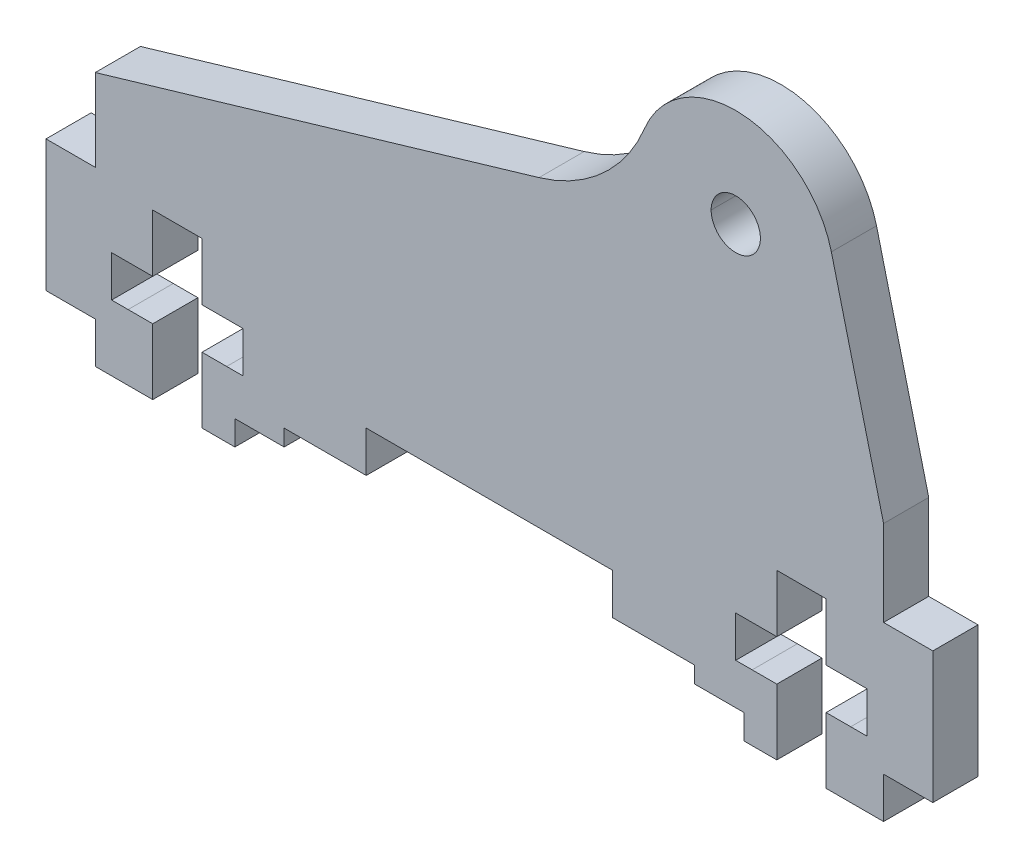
ISO-10303-21;
HEADER;
FILE_DESCRIPTION(('STEP AP214'),'2;1');
FILE_NAME('part.step','',(''),(''),'','','');
FILE_SCHEMA(('AUTOMOTIVE_DESIGN { 1 0 10303 214 1 1 1 1 }'));
ENDSEC;
DATA;
#1=APPLICATION_CONTEXT('core data for automotive mechanical design processes');
#2=APPLICATION_PROTOCOL_DEFINITION('international standard','automotive_design',2000,#1);
#3=PRODUCT_CONTEXT('',#1,'mechanical');
#4=PRODUCT('Part','Part','',(#3));
#5=PRODUCT_RELATED_PRODUCT_CATEGORY('part','',(#4));
#6=PRODUCT_DEFINITION_FORMATION('','',#4);
#7=PRODUCT_DEFINITION_CONTEXT('part definition',#1,'design');
#8=PRODUCT_DEFINITION('design','',#6,#7);
#9=PRODUCT_DEFINITION_SHAPE('','',#8);
#10=(LENGTH_UNIT() NAMED_UNIT(*) SI_UNIT(.MILLI.,.METRE.));
#11=(NAMED_UNIT(*) PLANE_ANGLE_UNIT() SI_UNIT($,.RADIAN.));
#12=(NAMED_UNIT(*) SI_UNIT($,.STERADIAN.) SOLID_ANGLE_UNIT());
#13=UNCERTAINTY_MEASURE_WITH_UNIT(LENGTH_MEASURE(1.E-05),#10,'distance_accuracy_value','');
#14=(GEOMETRIC_REPRESENTATION_CONTEXT(3) GLOBAL_UNCERTAINTY_ASSIGNED_CONTEXT((#13)) GLOBAL_UNIT_ASSIGNED_CONTEXT((#10,
#11,#12)) REPRESENTATION_CONTEXT('',''));
#15=CARTESIAN_POINT('',(0.,0.,0.));
#16=DIRECTION('',(0.,0.,1.));
#17=DIRECTION('',(1.,0.,0.));
#18=AXIS2_PLACEMENT_3D('',#15,#16,#17);
#19=CARTESIAN_POINT('',(208.924329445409,58.3099859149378,0.));
#20=DIRECTION('',(0.,0.,1.));
#21=DIRECTION('',(1.,0.,0.));
#22=AXIS2_PLACEMENT_3D('',#19,#20,#21);
#23=PLANE('',#22);
#24=CARTESIAN_POINT('',(208.924329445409,58.3099859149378,0.));
#25=DIRECTION('',(0.,0.,-1.));
#26=DIRECTION('',(-1.,0.,0.));
#27=AXIS2_PLACEMENT_3D('',#24,#25,#26);
#28=CIRCLE('',#27,1.5);
#29=CARTESIAN_POINT('',(210.424329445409,58.3099859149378,0.));
#30=VERTEX_POINT('',#29);
#31=CARTESIAN_POINT('',(207.424329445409,58.3099859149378,0.));
#32=VERTEX_POINT('',#31);
#33=EDGE_CURVE('E576',#30,#32,#28,.F.);
#34=ORIENTED_EDGE('',*,*,#33,.T.);
#35=CARTESIAN_POINT('',(208.924329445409,58.3099859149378,0.));
#36=DIRECTION('',(0.,0.,-1.));
#37=DIRECTION('',(-1.,0.,0.));
#38=AXIS2_PLACEMENT_3D('',#35,#36,#37);
#39=CIRCLE('',#38,1.5);
#40=EDGE_CURVE('E582',#32,#30,#39,.F.);
#41=ORIENTED_EDGE('',*,*,#40,.T.);
#42=EDGE_LOOP('',(#34,#41));
#43=FACE_BOUND('',#42,.T.);
#44=DIRECTION('',(1.,0.,0.));
#45=VECTOR('',#44,1.);
#46=CARTESIAN_POINT('',(208.92,35.31,0.));
#47=LINE('',#46,#45);
#48=CARTESIAN_POINT('',(208.92,35.31,0.));
#49=VERTEX_POINT('',#48);
#50=CARTESIAN_POINT('',(209.924329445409,35.31,0.));
#51=VERTEX_POINT('',#50);
#52=EDGE_CURVE('E422',#49,#51,#47,.T.);
#53=ORIENTED_EDGE('',*,*,#52,.T.);
#54=DIRECTION('',(0.,1.,0.));
#55=VECTOR('',#54,1.);
#56=CARTESIAN_POINT('',(209.924329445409,37.8099859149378,0.));
#57=LINE('',#56,#55);
#58=CARTESIAN_POINT('',(209.924329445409,35.3099859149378,0.));
#59=VERTEX_POINT('',#58);
#60=EDGE_CURVE('E608',#51,#59,#57,.F.);
#61=ORIENTED_EDGE('',*,*,#60,.T.);
#62=DIRECTION('',(1.,0.,0.));
#63=VECTOR('',#62,1.);
#64=CARTESIAN_POINT('',(208.924329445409,35.3099859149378,0.));
#65=LINE('',#64,#63);
#66=CARTESIAN_POINT('',(211.424329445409,35.3099859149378,0.));
#67=VERTEX_POINT('',#66);
#68=EDGE_CURVE('E765',#67,#59,#65,.F.);
#69=ORIENTED_EDGE('',*,*,#68,.F.);
#70=DIRECTION('',(0.,1.,0.));
#71=VECTOR('',#70,1.);
#72=CARTESIAN_POINT('',(211.424329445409,31.3099859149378,0.));
#73=LINE('',#72,#71);
#74=CARTESIAN_POINT('',(211.424329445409,31.3099859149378,0.));
#75=VERTEX_POINT('',#74);
#76=EDGE_CURVE('E613',#67,#75,#73,.F.);
#77=ORIENTED_EDGE('',*,*,#76,.T.);
#78=DIRECTION('',(-1.,0.,0.));
#79=VECTOR('',#78,1.);
#80=CARTESIAN_POINT('',(209.424329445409,31.3099859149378,0.));
#81=LINE('',#80,#79);
#82=CARTESIAN_POINT('',(209.424329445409,31.3099859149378,0.));
#83=VERTEX_POINT('',#82);
#84=EDGE_CURVE('E621',#75,#83,#81,.T.);
#85=ORIENTED_EDGE('',*,*,#84,.T.);
#86=DIRECTION('',(0.,1.,0.));
#87=VECTOR('',#86,1.);
#88=CARTESIAN_POINT('',(209.424329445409,58.3099859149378,0.));
#89=LINE('',#88,#87);
#90=CARTESIAN_POINT('',(209.424329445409,32.8099859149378,0.));
#91=VERTEX_POINT('',#90);
#92=EDGE_CURVE('E768',#91,#83,#89,.F.);
#93=ORIENTED_EDGE('',*,*,#92,.F.);
#94=DIRECTION('',(1.,0.,0.));
#95=VECTOR('',#94,1.);
#96=CARTESIAN_POINT('',(206.424329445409,32.8099859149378,0.));
#97=LINE('',#96,#95);
#98=CARTESIAN_POINT('',(206.424329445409,32.8099859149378,0.));
#99=VERTEX_POINT('',#98);
#100=EDGE_CURVE('E627',#91,#99,#97,.F.);
#101=ORIENTED_EDGE('',*,*,#100,.T.);
#102=DIRECTION('',(0.,1.,0.));
#103=VECTOR('',#102,1.);
#104=CARTESIAN_POINT('',(206.424329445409,58.3099859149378,0.));
#105=LINE('',#104,#103);
#106=CARTESIAN_POINT('',(206.424329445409,33.8099859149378,0.));
#107=VERTEX_POINT('',#106);
#108=EDGE_CURVE('E770',#107,#99,#105,.F.);
#109=ORIENTED_EDGE('',*,*,#108,.F.);
#110=DIRECTION('',(1.,0.,0.));
#111=VECTOR('',#110,1.);
#112=CARTESIAN_POINT('',(201.424329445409,33.8099859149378,0.));
#113=LINE('',#112,#111);
#114=CARTESIAN_POINT('',(201.424329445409,33.8099859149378,0.));
#115=VERTEX_POINT('',#114);
#116=EDGE_CURVE('E635',#107,#115,#113,.F.);
#117=ORIENTED_EDGE('',*,*,#116,.T.);
#118=DIRECTION('',(0.,1.,0.));
#119=VECTOR('',#118,1.);
#120=CARTESIAN_POINT('',(201.424329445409,33.8099859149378,0.));
#121=LINE('',#120,#119);
#122=CARTESIAN_POINT('',(201.424329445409,36.3099859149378,0.));
#123=VERTEX_POINT('',#122);
#124=EDGE_CURVE('E643',#115,#123,#121,.T.);
#125=ORIENTED_EDGE('',*,*,#124,.T.);
#126=DIRECTION('',(1.,0.,0.));
#127=VECTOR('',#126,1.);
#128=CARTESIAN_POINT('',(186.424329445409,36.3099859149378,0.));
#129=LINE('',#128,#127);
#130=CARTESIAN_POINT('',(186.424329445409,36.3099859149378,0.));
#131=VERTEX_POINT('',#130);
#132=EDGE_CURVE('E649',#123,#131,#129,.F.);
#133=ORIENTED_EDGE('',*,*,#132,.T.);
#134=DIRECTION('',(0.,1.,0.));
#135=VECTOR('',#134,1.);
#136=CARTESIAN_POINT('',(186.424329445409,33.8099859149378,0.));
#137=LINE('',#136,#135);
#138=CARTESIAN_POINT('',(186.424329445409,33.8099859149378,0.));
#139=VERTEX_POINT('',#138);
#140=EDGE_CURVE('E655',#131,#139,#137,.F.);
#141=ORIENTED_EDGE('',*,*,#140,.T.);
#142=DIRECTION('',(1.,0.,0.));
#143=VECTOR('',#142,1.);
#144=CARTESIAN_POINT('',(181.424329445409,33.8099859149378,0.));
#145=LINE('',#144,#143);
#146=CARTESIAN_POINT('',(181.424329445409,33.8099859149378,0.));
#147=VERTEX_POINT('',#146);
#148=EDGE_CURVE('E661',#139,#147,#145,.F.);
#149=ORIENTED_EDGE('',*,*,#148,.T.);
#150=DIRECTION('',(0.,1.,0.));
#151=VECTOR('',#150,1.);
#152=CARTESIAN_POINT('',(181.424329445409,58.3099859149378,0.));
#153=LINE('',#152,#151);
#154=CARTESIAN_POINT('',(181.424329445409,32.8099859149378,0.));
#155=VERTEX_POINT('',#154);
#156=EDGE_CURVE('E772',#155,#147,#153,.T.);
#157=ORIENTED_EDGE('',*,*,#156,.F.);
#158=DIRECTION('',(1.,0.,0.));
#159=VECTOR('',#158,1.);
#160=CARTESIAN_POINT('',(178.424329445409,32.8099859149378,0.));
#161=LINE('',#160,#159);
#162=CARTESIAN_POINT('',(178.424329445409,32.8099859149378,0.));
#163=VERTEX_POINT('',#162);
#164=EDGE_CURVE('E667',#155,#163,#161,.F.);
#165=ORIENTED_EDGE('',*,*,#164,.T.);
#166=DIRECTION('',(0.,1.,0.));
#167=VECTOR('',#166,1.);
#168=CARTESIAN_POINT('',(178.424329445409,58.3099859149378,0.));
#169=LINE('',#168,#167);
#170=CARTESIAN_POINT('',(178.424329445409,31.3099859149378,0.));
#171=VERTEX_POINT('',#170);
#172=EDGE_CURVE('E774',#171,#163,#169,.T.);
#173=ORIENTED_EDGE('',*,*,#172,.F.);
#174=DIRECTION('',(1.,0.,0.));
#175=VECTOR('',#174,1.);
#176=CARTESIAN_POINT('',(176.424329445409,31.3099859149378,0.));
#177=LINE('',#176,#175);
#178=CARTESIAN_POINT('',(176.424329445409,31.3099859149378,0.));
#179=VERTEX_POINT('',#178);
#180=EDGE_CURVE('E675',#171,#179,#177,.F.);
#181=ORIENTED_EDGE('',*,*,#180,.T.);
#182=DIRECTION('',(0.,1.,0.));
#183=VECTOR('',#182,1.);
#184=CARTESIAN_POINT('',(176.424329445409,31.3099859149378,0.));
#185=LINE('',#184,#183);
#186=CARTESIAN_POINT('',(176.424329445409,35.3099859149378,0.));
#187=VERTEX_POINT('',#186);
#188=EDGE_CURVE('E683',#179,#187,#185,.T.);
#189=ORIENTED_EDGE('',*,*,#188,.T.);
#190=DIRECTION('',(1.,0.,0.));
#191=VECTOR('',#190,1.);
#192=CARTESIAN_POINT('',(208.924329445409,35.3099859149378,0.));
#193=LINE('',#192,#191);
#194=CARTESIAN_POINT('',(177.924329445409,35.3099859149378,0.));
#195=VERTEX_POINT('',#194);
#196=EDGE_CURVE('E776',#195,#187,#193,.F.);
#197=ORIENTED_EDGE('',*,*,#196,.F.);
#198=DIRECTION('',(0.,1.,0.));
#199=VECTOR('',#198,1.);
#200=CARTESIAN_POINT('',(177.924329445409,35.3099859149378,0.));
#201=LINE('',#200,#199);
#202=CARTESIAN_POINT('',(177.924329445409,35.31,0.));
#203=VERTEX_POINT('',#202);
#204=EDGE_CURVE('E689',#195,#203,#201,.T.);
#205=ORIENTED_EDGE('',*,*,#204,.T.);
#206=DIRECTION('',(1.,0.,0.));
#207=VECTOR('',#206,1.);
#208=CARTESIAN_POINT('',(170.92,35.31,0.));
#209=LINE('',#208,#207);
#210=CARTESIAN_POINT('',(178.92,35.31,0.));
#211=VERTEX_POINT('',#210);
#212=EDGE_CURVE('E1579',#203,#211,#209,.T.);
#213=ORIENTED_EDGE('',*,*,#212,.T.);
#214=DIRECTION('',(0.,1.,0.));
#215=VECTOR('',#214,1.);
#216=CARTESIAN_POINT('',(178.92,37.81,0.));
#217=LINE('',#216,#215);
#218=CARTESIAN_POINT('',(178.92,37.81,0.));
#219=VERTEX_POINT('',#218);
#220=EDGE_CURVE('E846',#211,#219,#217,.T.);
#221=ORIENTED_EDGE('',*,*,#220,.T.);
#222=DIRECTION('',(-1.,0.,0.));
#223=VECTOR('',#222,1.);
#224=CARTESIAN_POINT('',(170.92,37.81,0.));
#225=LINE('',#224,#223);
#226=CARTESIAN_POINT('',(176.424329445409,37.8099929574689,0.));
#227=VERTEX_POINT('',#226);
#228=EDGE_CURVE('E837',#219,#227,#225,.T.);
#229=ORIENTED_EDGE('',*,*,#228,.T.);
#230=DIRECTION('',(0.,1.,0.));
#231=VECTOR('',#230,1.);
#232=CARTESIAN_POINT('',(176.424329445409,37.8099859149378,0.));
#233=LINE('',#232,#231);
#234=CARTESIAN_POINT('',(176.424329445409,41.3099859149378,0.));
#235=VERTEX_POINT('',#234);
#236=EDGE_CURVE('E694',#227,#235,#233,.T.);
#237=ORIENTED_EDGE('',*,*,#236,.T.);
#238=DIRECTION('',(1.,0.,0.));
#239=VECTOR('',#238,1.);
#240=CARTESIAN_POINT('',(176.424329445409,41.3099859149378,0.));
#241=LINE('',#240,#239);
#242=CARTESIAN_POINT('',(173.424329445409,41.3099859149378,0.));
#243=VERTEX_POINT('',#242);
#244=EDGE_CURVE('E1654',#235,#243,#241,.F.);
#245=ORIENTED_EDGE('',*,*,#244,.T.);
#246=DIRECTION('',(0.,1.,0.));
#247=VECTOR('',#246,1.);
#248=CARTESIAN_POINT('',(173.424329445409,37.8099859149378,0.));
#249=LINE('',#248,#247);
#250=CARTESIAN_POINT('',(173.424329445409,37.8099929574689,0.));
#251=VERTEX_POINT('',#250);
#252=EDGE_CURVE('E704',#243,#251,#249,.F.);
#253=ORIENTED_EDGE('',*,*,#252,.T.);
#254=CARTESIAN_POINT('',(170.92,37.81,0.));
#255=VERTEX_POINT('',#254);
#256=EDGE_CURVE('E841',#251,#255,#225,.T.);
#257=ORIENTED_EDGE('',*,*,#256,.T.);
#258=DIRECTION('',(0.,-1.,0.));
#259=VECTOR('',#258,1.);
#260=CARTESIAN_POINT('',(170.92,37.81,0.));
#261=LINE('',#260,#259);
#262=CARTESIAN_POINT('',(170.92,35.31,0.));
#263=VERTEX_POINT('',#262);
#264=EDGE_CURVE('E1625',#255,#263,#261,.T.);
#265=ORIENTED_EDGE('',*,*,#264,.T.);
#266=CARTESIAN_POINT('',(171.924329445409,35.31,0.));
#267=VERTEX_POINT('',#266);
#268=EDGE_CURVE('E819',#263,#267,#209,.T.);
#269=ORIENTED_EDGE('',*,*,#268,.T.);
#270=DIRECTION('',(0.,1.,0.));
#271=VECTOR('',#270,1.);
#272=CARTESIAN_POINT('',(171.924329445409,35.3099859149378,0.));
#273=LINE('',#272,#271);
#274=CARTESIAN_POINT('',(171.924329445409,35.3099859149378,0.));
#275=VERTEX_POINT('',#274);
#276=EDGE_CURVE('E709',#267,#275,#273,.F.);
#277=ORIENTED_EDGE('',*,*,#276,.T.);
#278=DIRECTION('',(1.,0.,0.));
#279=VECTOR('',#278,1.);
#280=CARTESIAN_POINT('',(208.924329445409,35.3099859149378,0.));
#281=LINE('',#280,#279);
#282=CARTESIAN_POINT('',(173.424329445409,35.3099859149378,0.));
#283=VERTEX_POINT('',#282);
#284=EDGE_CURVE('E778',#283,#275,#281,.F.);
#285=ORIENTED_EDGE('',*,*,#284,.F.);
#286=DIRECTION('',(0.,1.,0.));
#287=VECTOR('',#286,1.);
#288=CARTESIAN_POINT('',(173.424329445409,31.3099859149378,0.));
#289=LINE('',#288,#287);
#290=CARTESIAN_POINT('',(173.424329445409,31.3099859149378,0.));
#291=VERTEX_POINT('',#290);
#292=EDGE_CURVE('E718',#283,#291,#289,.F.);
#293=ORIENTED_EDGE('',*,*,#292,.T.);
#294=DIRECTION('',(1.,0.,0.));
#295=VECTOR('',#294,1.);
#296=CARTESIAN_POINT('',(169.924329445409,31.3099859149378,0.));
#297=LINE('',#296,#295);
#298=CARTESIAN_POINT('',(169.924329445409,31.3099859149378,0.));
#299=VERTEX_POINT('',#298);
#300=EDGE_CURVE('E726',#291,#299,#297,.F.);
#301=ORIENTED_EDGE('',*,*,#300,.T.);
#302=DIRECTION('',(0.,1.,0.));
#303=VECTOR('',#302,1.);
#304=CARTESIAN_POINT('',(169.924329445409,58.3099859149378,0.));
#305=LINE('',#304,#303);
#306=CARTESIAN_POINT('',(169.924329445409,33.8099859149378,0.));
#307=VERTEX_POINT('',#306);
#308=EDGE_CURVE('E571',#307,#299,#305,.F.);
#309=ORIENTED_EDGE('',*,*,#308,.F.);
#310=DIRECTION('',(-1.,0.,0.));
#311=VECTOR('',#310,1.);
#312=CARTESIAN_POINT('',(166.924329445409,33.8099859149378,0.));
#313=LINE('',#312,#311);
#314=CARTESIAN_POINT('',(166.924329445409,33.8099859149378,0.));
#315=VERTEX_POINT('',#314);
#316=EDGE_CURVE('E557',#307,#315,#313,.T.);
#317=ORIENTED_EDGE('',*,*,#316,.T.);
#318=DIRECTION('',(0.,1.,0.));
#319=VECTOR('',#318,1.);
#320=CARTESIAN_POINT('',(166.924329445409,32.8099859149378,0.));
#321=LINE('',#320,#319);
#322=CARTESIAN_POINT('',(166.924329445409,41.8099859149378,0.));
#323=VERTEX_POINT('',#322);
#324=EDGE_CURVE('E732',#315,#323,#321,.T.);
#325=ORIENTED_EDGE('',*,*,#324,.T.);
#326=DIRECTION('',(1.,0.,0.));
#327=VECTOR('',#326,1.);
#328=CARTESIAN_POINT('',(166.924329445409,41.8099859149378,0.));
#329=LINE('',#328,#327);
#330=CARTESIAN_POINT('',(169.924329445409,41.8099859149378,0.));
#331=VERTEX_POINT('',#330);
#332=EDGE_CURVE('E564',#323,#331,#329,.T.);
#333=ORIENTED_EDGE('',*,*,#332,.T.);
#334=DIRECTION('',(0.,1.,0.));
#335=VECTOR('',#334,1.);
#336=CARTESIAN_POINT('',(169.924329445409,42.8099859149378,0.));
#337=LINE('',#336,#335);
#338=CARTESIAN_POINT('',(169.924329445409,46.8099859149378,0.));
#339=VERTEX_POINT('',#338);
#340=EDGE_CURVE('E735',#331,#339,#337,.T.);
#341=ORIENTED_EDGE('',*,*,#340,.T.);
#342=DIRECTION('',(0.959169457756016,0.282832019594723,0.));
#343=VECTOR('',#342,1.);
#344=CARTESIAN_POINT('',(169.924329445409,46.8099859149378,0.));
#345=LINE('',#344,#343);
#346=CARTESIAN_POINT('',(196.944306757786,54.7774151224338,0.));
#347=VERTEX_POINT('',#346);
#348=EDGE_CURVE('E739',#339,#347,#345,.T.);
#349=ORIENTED_EDGE('',*,*,#348,.T.);
#350=CARTESIAN_POINT('',(194.115986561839,64.369109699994,0.));
#351=DIRECTION('',(0.,0.,-1.));
#352=DIRECTION('',(-1.,0.,0.));
#353=AXIS2_PLACEMENT_3D('',#350,#351,#352);
#354=CIRCLE('',#353,10.);
#355=CARTESIAN_POINT('',(203.37120086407,60.5821573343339,0.));
#356=VERTEX_POINT('',#355);
#357=EDGE_CURVE('E740',#347,#356,#354,.F.);
#358=ORIENTED_EDGE('',*,*,#357,.T.);
#359=CARTESIAN_POINT('',(208.924329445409,58.3099859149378,0.));
#360=DIRECTION('',(0.,0.,-1.));
#361=DIRECTION('',(-1.,0.,0.));
#362=AXIS2_PLACEMENT_3D('',#359,#360,#361);
#363=CIRCLE('',#362,6.00000000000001);
#364=CARTESIAN_POINT('',(214.745710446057,59.763094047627,0.));
#365=VERTEX_POINT('',#364);
#366=EDGE_CURVE('E751',#365,#356,#363,.F.);
#367=ORIENTED_EDGE('',*,*,#366,.F.);
#368=DIRECTION('',(0.242184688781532,-0.970230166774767,0.));
#369=VECTOR('',#368,1.);
#370=CARTESIAN_POINT('',(217.924329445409,47.0290436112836,0.));
#371=LINE('',#370,#369);
#372=CARTESIAN_POINT('',(217.924329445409,47.0290436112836,0.));
#373=VERTEX_POINT('',#372);
#374=EDGE_CURVE('E755',#365,#373,#371,.T.);
#375=ORIENTED_EDGE('',*,*,#374,.T.);
#376=DIRECTION('',(0.,1.,0.));
#377=VECTOR('',#376,1.);
#378=CARTESIAN_POINT('',(217.924329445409,42.8099859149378,0.));
#379=LINE('',#378,#377);
#380=CARTESIAN_POINT('',(217.924329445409,41.8099859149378,0.));
#381=VERTEX_POINT('',#380);
#382=EDGE_CURVE('E756',#373,#381,#379,.F.);
#383=ORIENTED_EDGE('',*,*,#382,.T.);
#384=DIRECTION('',(1.,0.,0.));
#385=VECTOR('',#384,1.);
#386=CARTESIAN_POINT('',(220.924329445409,41.8099859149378,0.));
#387=LINE('',#386,#385);
#388=CARTESIAN_POINT('',(220.924329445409,41.8099859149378,0.));
#389=VERTEX_POINT('',#388);
#390=EDGE_CURVE('E543',#381,#389,#387,.T.);
#391=ORIENTED_EDGE('',*,*,#390,.T.);
#392=DIRECTION('',(0.,-1.,0.));
#393=VECTOR('',#392,1.);
#394=CARTESIAN_POINT('',(220.924329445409,32.8099859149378,0.));
#395=LINE('',#394,#393);
#396=CARTESIAN_POINT('',(220.924329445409,33.8099859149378,0.));
#397=VERTEX_POINT('',#396);
#398=EDGE_CURVE('E762',#389,#397,#395,.T.);
#399=ORIENTED_EDGE('',*,*,#398,.T.);
#400=DIRECTION('',(-1.,0.,0.));
#401=VECTOR('',#400,1.);
#402=CARTESIAN_POINT('',(217.924329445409,33.8099859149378,0.));
#403=LINE('',#402,#401);
#404=CARTESIAN_POINT('',(217.924329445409,33.8099859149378,0.));
#405=VERTEX_POINT('',#404);
#406=EDGE_CURVE('E550',#397,#405,#403,.T.);
#407=ORIENTED_EDGE('',*,*,#406,.T.);
#408=DIRECTION('',(0.,1.,0.));
#409=VECTOR('',#408,1.);
#410=CARTESIAN_POINT('',(217.924329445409,58.3099859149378,0.));
#411=LINE('',#410,#409);
#412=CARTESIAN_POINT('',(217.924329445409,31.3099859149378,0.));
#413=VERTEX_POINT('',#412);
#414=EDGE_CURVE('E759',#413,#405,#411,.T.);
#415=ORIENTED_EDGE('',*,*,#414,.F.);
#416=DIRECTION('',(-1.,0.,0.));
#417=VECTOR('',#416,1.);
#418=CARTESIAN_POINT('',(214.424329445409,31.3099859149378,0.));
#419=LINE('',#418,#417);
#420=CARTESIAN_POINT('',(214.424329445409,31.3099859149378,0.));
#421=VERTEX_POINT('',#420);
#422=EDGE_CURVE('E579',#413,#421,#419,.T.);
#423=ORIENTED_EDGE('',*,*,#422,.T.);
#424=DIRECTION('',(0.,1.,0.));
#425=VECTOR('',#424,1.);
#426=CARTESIAN_POINT('',(214.424329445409,31.3099859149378,0.));
#427=LINE('',#426,#425);
#428=CARTESIAN_POINT('',(214.424329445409,35.3099859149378,0.));
#429=VERTEX_POINT('',#428);
#430=EDGE_CURVE('E588',#421,#429,#427,.T.);
#431=ORIENTED_EDGE('',*,*,#430,.T.);
#432=DIRECTION('',(1.,0.,0.));
#433=VECTOR('',#432,1.);
#434=CARTESIAN_POINT('',(208.924329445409,35.3099859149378,0.));
#435=LINE('',#434,#433);
#436=CARTESIAN_POINT('',(215.924329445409,35.3099859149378,0.));
#437=VERTEX_POINT('',#436);
#438=EDGE_CURVE('E763',#437,#429,#435,.F.);
#439=ORIENTED_EDGE('',*,*,#438,.F.);
#440=DIRECTION('',(0.,1.,0.));
#441=VECTOR('',#440,1.);
#442=CARTESIAN_POINT('',(215.924329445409,37.8099859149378,0.));
#443=LINE('',#442,#441);
#444=CARTESIAN_POINT('',(215.924329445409,35.31,0.));
#445=VERTEX_POINT('',#444);
#446=EDGE_CURVE('E594',#437,#445,#443,.T.);
#447=ORIENTED_EDGE('',*,*,#446,.T.);
#448=CARTESIAN_POINT('',(216.92,35.31,0.));
#449=VERTEX_POINT('',#448);
#450=EDGE_CURVE('E47',#445,#449,#47,.T.);
#451=ORIENTED_EDGE('',*,*,#450,.T.);
#452=DIRECTION('',(0.,1.,0.));
#453=VECTOR('',#452,1.);
#454=CARTESIAN_POINT('',(216.92,37.81,0.));
#455=LINE('',#454,#453);
#456=CARTESIAN_POINT('',(216.92,37.81,0.));
#457=VERTEX_POINT('',#456);
#458=EDGE_CURVE('E428',#449,#457,#455,.T.);
#459=ORIENTED_EDGE('',*,*,#458,.T.);
#460=DIRECTION('',(-1.,0.,0.));
#461=VECTOR('',#460,1.);
#462=CARTESIAN_POINT('',(208.92,37.81,0.));
#463=LINE('',#462,#461);
#464=CARTESIAN_POINT('',(214.424329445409,37.8099929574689,0.));
#465=VERTEX_POINT('',#464);
#466=EDGE_CURVE('E445',#457,#465,#463,.T.);
#467=ORIENTED_EDGE('',*,*,#466,.T.);
#468=DIRECTION('',(0.,1.,0.));
#469=VECTOR('',#468,1.);
#470=CARTESIAN_POINT('',(214.424329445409,37.8099859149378,0.));
#471=LINE('',#470,#469);
#472=CARTESIAN_POINT('',(214.424329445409,41.3099859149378,0.));
#473=VERTEX_POINT('',#472);
#474=EDGE_CURVE('E597',#465,#473,#471,.T.);
#475=ORIENTED_EDGE('',*,*,#474,.T.);
#476=DIRECTION('',(1.,0.,0.));
#477=VECTOR('',#476,1.);
#478=CARTESIAN_POINT('',(214.424329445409,41.3099859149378,0.));
#479=LINE('',#478,#477);
#480=CARTESIAN_POINT('',(211.424329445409,41.3099859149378,0.));
#481=VERTEX_POINT('',#480);
#482=EDGE_CURVE('E601',#473,#481,#479,.F.);
#483=ORIENTED_EDGE('',*,*,#482,.T.);
#484=DIRECTION('',(0.,1.,0.));
#485=VECTOR('',#484,1.);
#486=CARTESIAN_POINT('',(211.424329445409,37.8099859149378,0.));
#487=LINE('',#486,#485);
#488=CARTESIAN_POINT('',(211.424329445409,37.8099964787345,0.));
#489=VERTEX_POINT('',#488);
#490=EDGE_CURVE('E607',#481,#489,#487,.F.);
#491=ORIENTED_EDGE('',*,*,#490,.T.);
#492=CARTESIAN_POINT('',(208.92,37.81,0.));
#493=VERTEX_POINT('',#492);
#494=EDGE_CURVE('E432',#489,#493,#463,.T.);
#495=ORIENTED_EDGE('',*,*,#494,.T.);
#496=DIRECTION('',(0.,-1.,0.));
#497=VECTOR('',#496,1.);
#498=CARTESIAN_POINT('',(208.92,37.81,0.));
#499=LINE('',#498,#497);
#500=EDGE_CURVE('E414',#493,#49,#499,.T.);
#501=ORIENTED_EDGE('',*,*,#500,.T.);
#502=EDGE_LOOP('',(#53,#61,#69,#77,#85,#93,#101,#109,#117,#125,#133,#141,#149,#157,#165,#173,
#181,#189,#197,#205,#213,#221,#229,#237,#245,#253,#257,#265,#269,#277,#285,#293,#301,#309,#317,
#325,#333,#341,#349,#358,#367,#375,#383,#391,#399,#407,#415,#423,#431,#439,#447,#451,#459,#467,
#475,#483,#491,#495,#501));
#503=FACE_BOUND('',#502,.T.);
#504=ADVANCED_FACE('F31',(#43,#503),#23,.F.);
#505=CARTESIAN_POINT('',(270.,64.3099859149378,2.75));
#506=DIRECTION('',(0.,0.,1.));
#507=DIRECTION('',(0.,-1.,0.));
#508=AXIS2_PLACEMENT_3D('',#505,#506,#507);
#509=PLANE('',#508);
#510=CARTESIAN_POINT('',(208.924329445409,58.3099859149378,2.75));
#511=DIRECTION('',(0.,0.,1.));
#512=DIRECTION('',(0.,-1.,0.));
#513=AXIS2_PLACEMENT_3D('',#510,#511,#512);
#514=CIRCLE('',#513,1.5);
#515=CARTESIAN_POINT('',(210.424329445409,58.3099859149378,2.75));
#516=VERTEX_POINT('',#515);
#517=CARTESIAN_POINT('',(207.424329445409,58.3099859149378,2.75));
#518=VERTEX_POINT('',#517);
#519=EDGE_CURVE('E889',#516,#518,#514,.F.);
#520=ORIENTED_EDGE('',*,*,#519,.T.);
#521=CARTESIAN_POINT('',(208.924329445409,58.3099859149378,2.75));
#522=DIRECTION('',(0.,0.,1.));
#523=DIRECTION('',(0.,-1.,0.));
#524=AXIS2_PLACEMENT_3D('',#521,#522,#523);
#525=CIRCLE('',#524,1.5);
#526=EDGE_CURVE('E887',#518,#516,#525,.F.);
#527=ORIENTED_EDGE('',*,*,#526,.T.);
#528=EDGE_LOOP('',(#520,#527));
#529=FACE_BOUND('',#528,.T.);
#530=DIRECTION('',(0.,1.,0.));
#531=VECTOR('',#530,1.);
#532=CARTESIAN_POINT('',(209.924329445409,37.8099859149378,2.75));
#533=LINE('',#532,#531);
#534=CARTESIAN_POINT('',(209.924329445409,35.3099859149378,2.75));
#535=VERTEX_POINT('',#534);
#536=CARTESIAN_POINT('',(209.924329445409,35.31,2.75));
#537=VERTEX_POINT('',#536);
#538=EDGE_CURVE('E464',#535,#537,#533,.T.);
#539=ORIENTED_EDGE('',*,*,#538,.T.);
#540=DIRECTION('',(-1.,0.,0.));
#541=VECTOR('',#540,1.);
#542=CARTESIAN_POINT('',(270.,35.31,2.75));
#543=LINE('',#542,#541);
#544=CARTESIAN_POINT('',(208.92,35.31,2.75));
#545=VERTEX_POINT('',#544);
#546=EDGE_CURVE('E462',#537,#545,#543,.T.);
#547=ORIENTED_EDGE('',*,*,#546,.T.);
#548=DIRECTION('',(0.,1.,0.));
#549=VECTOR('',#548,1.);
#550=CARTESIAN_POINT('',(208.92,64.3099859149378,2.75));
#551=LINE('',#550,#549);
#552=CARTESIAN_POINT('',(208.92,37.81,2.75));
#553=VERTEX_POINT('',#552);
#554=EDGE_CURVE('E11',#545,#553,#551,.T.);
#555=ORIENTED_EDGE('',*,*,#554,.T.);
#556=DIRECTION('',(1.,0.,0.));
#557=VECTOR('',#556,1.);
#558=CARTESIAN_POINT('',(270.,37.81,2.75));
#559=LINE('',#558,#557);
#560=CARTESIAN_POINT('',(211.424329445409,37.81,2.75));
#561=VERTEX_POINT('',#560);
#562=EDGE_CURVE('E457',#553,#561,#559,.T.);
#563=ORIENTED_EDGE('',*,*,#562,.T.);
#564=DIRECTION('',(0.,1.,0.));
#565=VECTOR('',#564,1.);
#566=CARTESIAN_POINT('',(211.424329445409,37.8099859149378,2.75));
#567=LINE('',#566,#565);
#568=CARTESIAN_POINT('',(211.424329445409,41.3099859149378,2.75));
#569=VERTEX_POINT('',#568);
#570=EDGE_CURVE('E494',#561,#569,#567,.T.);
#571=ORIENTED_EDGE('',*,*,#570,.T.);
#572=DIRECTION('',(1.,0.,0.));
#573=VECTOR('',#572,1.);
#574=CARTESIAN_POINT('',(214.424329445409,41.3099859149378,2.75));
#575=LINE('',#574,#573);
#576=CARTESIAN_POINT('',(214.424329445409,41.3099859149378,2.75));
#577=VERTEX_POINT('',#576);
#578=EDGE_CURVE('E487',#569,#577,#575,.T.);
#579=ORIENTED_EDGE('',*,*,#578,.T.);
#580=DIRECTION('',(0.,-1.,0.));
#581=VECTOR('',#580,1.);
#582=CARTESIAN_POINT('',(214.424329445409,37.8099859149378,2.75));
#583=LINE('',#582,#581);
#584=CARTESIAN_POINT('',(214.424329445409,37.81,2.75));
#585=VERTEX_POINT('',#584);
#586=EDGE_CURVE('E483',#577,#585,#583,.T.);
#587=ORIENTED_EDGE('',*,*,#586,.T.);
#588=CARTESIAN_POINT('',(216.92,37.81,2.75));
#589=VERTEX_POINT('',#588);
#590=EDGE_CURVE('E465',#585,#589,#559,.T.);
#591=ORIENTED_EDGE('',*,*,#590,.T.);
#592=DIRECTION('',(0.,-1.,0.));
#593=VECTOR('',#592,1.);
#594=CARTESIAN_POINT('',(216.92,64.3099859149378,2.75));
#595=LINE('',#594,#593);
#596=CARTESIAN_POINT('',(216.92,35.31,2.75));
#597=VERTEX_POINT('',#596);
#598=EDGE_CURVE('E40',#589,#597,#595,.T.);
#599=ORIENTED_EDGE('',*,*,#598,.T.);
#600=CARTESIAN_POINT('',(215.924329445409,35.31,2.75));
#601=VERTEX_POINT('',#600);
#602=EDGE_CURVE('E418',#597,#601,#543,.T.);
#603=ORIENTED_EDGE('',*,*,#602,.T.);
#604=DIRECTION('',(0.,-1.,0.));
#605=VECTOR('',#604,1.);
#606=CARTESIAN_POINT('',(215.924329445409,37.8099859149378,2.75));
#607=LINE('',#606,#605);
#608=CARTESIAN_POINT('',(215.924329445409,35.3099859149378,2.75));
#609=VERTEX_POINT('',#608);
#610=EDGE_CURVE('E473',#601,#609,#607,.T.);
#611=ORIENTED_EDGE('',*,*,#610,.T.);
#612=DIRECTION('',(-1.,0.,0.));
#613=VECTOR('',#612,1.);
#614=CARTESIAN_POINT('',(214.424329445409,35.3099859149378,2.75));
#615=LINE('',#614,#613);
#616=CARTESIAN_POINT('',(214.424329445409,35.3099859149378,2.75));
#617=VERTEX_POINT('',#616);
#618=EDGE_CURVE('E484',#609,#617,#615,.T.);
#619=ORIENTED_EDGE('',*,*,#618,.T.);
#620=DIRECTION('',(0.,-1.,0.));
#621=VECTOR('',#620,1.);
#622=CARTESIAN_POINT('',(214.424329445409,31.3099859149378,2.75));
#623=LINE('',#622,#621);
#624=CARTESIAN_POINT('',(214.424329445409,31.3099859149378,2.75));
#625=VERTEX_POINT('',#624);
#626=EDGE_CURVE('E489',#617,#625,#623,.T.);
#627=ORIENTED_EDGE('',*,*,#626,.T.);
#628=DIRECTION('',(-1.,0.,0.));
#629=VECTOR('',#628,1.);
#630=CARTESIAN_POINT('',(270.,31.3099859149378,2.75));
#631=LINE('',#630,#629);
#632=CARTESIAN_POINT('',(217.924329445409,31.3099859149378,2.75));
#633=VERTEX_POINT('',#632);
#634=EDGE_CURVE('E856',#633,#625,#631,.T.);
#635=ORIENTED_EDGE('',*,*,#634,.F.);
#636=DIRECTION('',(0.,1.,0.));
#637=VECTOR('',#636,1.);
#638=CARTESIAN_POINT('',(217.924329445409,31.3099859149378,2.75));
#639=LINE('',#638,#637);
#640=CARTESIAN_POINT('',(217.924329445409,33.8099859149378,2.75));
#641=VERTEX_POINT('',#640);
#642=EDGE_CURVE('E867',#633,#641,#639,.T.);
#643=ORIENTED_EDGE('',*,*,#642,.T.);
#644=DIRECTION('',(-1.,0.,0.));
#645=VECTOR('',#644,1.);
#646=CARTESIAN_POINT('',(217.924329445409,33.8099859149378,2.75));
#647=LINE('',#646,#645);
#648=CARTESIAN_POINT('',(220.924329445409,33.8099859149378,2.75));
#649=VERTEX_POINT('',#648);
#650=EDGE_CURVE('E861',#649,#641,#647,.T.);
#651=ORIENTED_EDGE('',*,*,#650,.F.);
#652=DIRECTION('',(0.,1.,0.));
#653=VECTOR('',#652,1.);
#654=CARTESIAN_POINT('',(220.924329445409,32.8099859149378,2.75));
#655=LINE('',#654,#653);
#656=CARTESIAN_POINT('',(220.924329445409,41.8099859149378,2.75));
#657=VERTEX_POINT('',#656);
#658=EDGE_CURVE('E859',#649,#657,#655,.T.);
#659=ORIENTED_EDGE('',*,*,#658,.T.);
#660=DIRECTION('',(1.,0.,0.));
#661=VECTOR('',#660,1.);
#662=CARTESIAN_POINT('',(220.924329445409,41.8099859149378,2.75));
#663=LINE('',#662,#661);
#664=CARTESIAN_POINT('',(217.924329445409,41.8099859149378,2.75));
#665=VERTEX_POINT('',#664);
#666=EDGE_CURVE('E578',#665,#657,#663,.T.);
#667=ORIENTED_EDGE('',*,*,#666,.F.);
#668=DIRECTION('',(0.,1.,0.));
#669=VECTOR('',#668,1.);
#670=CARTESIAN_POINT('',(217.924329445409,42.8099859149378,2.75));
#671=LINE('',#670,#669);
#672=CARTESIAN_POINT('',(217.924329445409,47.0290436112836,2.75));
#673=VERTEX_POINT('',#672);
#674=EDGE_CURVE('E857',#665,#673,#671,.T.);
#675=ORIENTED_EDGE('',*,*,#674,.T.);
#676=DIRECTION('',(-0.242184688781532,0.970230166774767,0.));
#677=VECTOR('',#676,1.);
#678=CARTESIAN_POINT('',(217.924329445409,47.0290436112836,2.75));
#679=LINE('',#678,#677);
#680=CARTESIAN_POINT('',(214.745710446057,59.763094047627,2.75));
#681=VERTEX_POINT('',#680);
#682=EDGE_CURVE('E864',#673,#681,#679,.T.);
#683=ORIENTED_EDGE('',*,*,#682,.T.);
#684=CARTESIAN_POINT('',(208.924329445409,58.3099859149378,2.75));
#685=DIRECTION('',(0.,0.,1.));
#686=DIRECTION('',(0.,-1.,0.));
#687=AXIS2_PLACEMENT_3D('',#684,#685,#686);
#688=CIRCLE('',#687,6.00000000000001);
#689=CARTESIAN_POINT('',(203.37120086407,60.5821573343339,2.75));
#690=VERTEX_POINT('',#689);
#691=EDGE_CURVE('E869',#690,#681,#688,.F.);
#692=ORIENTED_EDGE('',*,*,#691,.F.);
#693=CARTESIAN_POINT('',(194.115986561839,64.369109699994,2.75));
#694=DIRECTION('',(0.,0.,1.));
#695=DIRECTION('',(0.,-1.,0.));
#696=AXIS2_PLACEMENT_3D('',#693,#694,#695);
#697=CIRCLE('',#696,10.);
#698=CARTESIAN_POINT('',(196.944306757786,54.7774151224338,2.75));
#699=VERTEX_POINT('',#698);
#700=EDGE_CURVE('E871',#690,#699,#697,.F.);
#701=ORIENTED_EDGE('',*,*,#700,.T.);
#702=DIRECTION('',(-0.959169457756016,-0.282832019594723,0.));
#703=VECTOR('',#702,1.);
#704=CARTESIAN_POINT('',(169.924329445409,46.8099859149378,2.75));
#705=LINE('',#704,#703);
#706=CARTESIAN_POINT('',(169.924329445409,46.8099859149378,2.75));
#707=VERTEX_POINT('',#706);
#708=EDGE_CURVE('E873',#699,#707,#705,.T.);
#709=ORIENTED_EDGE('',*,*,#708,.T.);
#710=DIRECTION('',(0.,-1.,0.));
#711=VECTOR('',#710,1.);
#712=CARTESIAN_POINT('',(169.924329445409,42.8099859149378,2.75));
#713=LINE('',#712,#711);
#714=CARTESIAN_POINT('',(169.924329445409,41.8099859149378,2.75));
#715=VERTEX_POINT('',#714);
#716=EDGE_CURVE('E875',#707,#715,#713,.T.);
#717=ORIENTED_EDGE('',*,*,#716,.T.);
#718=DIRECTION('',(1.,0.,0.));
#719=VECTOR('',#718,1.);
#720=CARTESIAN_POINT('',(166.924329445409,41.8099859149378,2.75));
#721=LINE('',#720,#719);
#722=CARTESIAN_POINT('',(166.924329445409,41.8099859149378,2.75));
#723=VERTEX_POINT('',#722);
#724=EDGE_CURVE('E877',#723,#715,#721,.T.);
#725=ORIENTED_EDGE('',*,*,#724,.F.);
#726=DIRECTION('',(0.,-1.,0.));
#727=VECTOR('',#726,1.);
#728=CARTESIAN_POINT('',(166.924329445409,32.8099859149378,2.75));
#729=LINE('',#728,#727);
#730=CARTESIAN_POINT('',(166.924329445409,33.8099859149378,2.75));
#731=VERTEX_POINT('',#730);
#732=EDGE_CURVE('E880',#723,#731,#729,.T.);
#733=ORIENTED_EDGE('',*,*,#732,.T.);
#734=DIRECTION('',(-1.,0.,0.));
#735=VECTOR('',#734,1.);
#736=CARTESIAN_POINT('',(166.924329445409,33.8099859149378,2.75));
#737=LINE('',#736,#735);
#738=CARTESIAN_POINT('',(169.924329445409,33.8099859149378,2.75));
#739=VERTEX_POINT('',#738);
#740=EDGE_CURVE('E882',#739,#731,#737,.T.);
#741=ORIENTED_EDGE('',*,*,#740,.F.);
#742=DIRECTION('',(0.,-1.,0.));
#743=VECTOR('',#742,1.);
#744=CARTESIAN_POINT('',(169.924329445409,31.3099859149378,2.75));
#745=LINE('',#744,#743);
#746=CARTESIAN_POINT('',(169.924329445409,31.3099859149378,2.75));
#747=VERTEX_POINT('',#746);
#748=EDGE_CURVE('E885',#739,#747,#745,.T.);
#749=ORIENTED_EDGE('',*,*,#748,.T.);
#750=CARTESIAN_POINT('',(173.424329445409,31.3099859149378,2.75));
#751=VERTEX_POINT('',#750);
#752=EDGE_CURVE('E833',#751,#747,#631,.T.);
#753=ORIENTED_EDGE('',*,*,#752,.F.);
#754=DIRECTION('',(0.,1.,0.));
#755=VECTOR('',#754,1.);
#756=CARTESIAN_POINT('',(173.424329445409,31.3099859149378,2.75));
#757=LINE('',#756,#755);
#758=CARTESIAN_POINT('',(173.424329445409,35.3099859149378,2.75));
#759=VERTEX_POINT('',#758);
#760=EDGE_CURVE('E541',#751,#759,#757,.T.);
#761=ORIENTED_EDGE('',*,*,#760,.T.);
#762=DIRECTION('',(-1.,0.,0.));
#763=VECTOR('',#762,1.);
#764=CARTESIAN_POINT('',(171.924329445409,35.3099859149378,2.75));
#765=LINE('',#764,#763);
#766=CARTESIAN_POINT('',(171.924329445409,35.3099859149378,2.75));
#767=VERTEX_POINT('',#766);
#768=EDGE_CURVE('E539',#759,#767,#765,.T.);
#769=ORIENTED_EDGE('',*,*,#768,.T.);
#770=DIRECTION('',(0.,1.,0.));
#771=VECTOR('',#770,1.);
#772=CARTESIAN_POINT('',(171.924329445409,35.3099859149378,2.75));
#773=LINE('',#772,#771);
#774=CARTESIAN_POINT('',(171.924329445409,35.31,2.75));
#775=VERTEX_POINT('',#774);
#776=EDGE_CURVE('E536',#767,#775,#773,.T.);
#777=ORIENTED_EDGE('',*,*,#776,.T.);
#778=DIRECTION('',(-1.,0.,0.));
#779=VECTOR('',#778,1.);
#780=CARTESIAN_POINT('',(270.,35.31,2.75));
#781=LINE('',#780,#779);
#782=CARTESIAN_POINT('',(170.92,35.31,2.75));
#783=VERTEX_POINT('',#782);
#784=EDGE_CURVE('E800',#775,#783,#781,.T.);
#785=ORIENTED_EDGE('',*,*,#784,.T.);
#786=DIRECTION('',(0.,1.,0.));
#787=VECTOR('',#786,1.);
#788=CARTESIAN_POINT('',(170.92,64.3099859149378,2.75));
#789=LINE('',#788,#787);
#790=CARTESIAN_POINT('',(170.92,37.81,2.75));
#791=VERTEX_POINT('',#790);
#792=EDGE_CURVE('E702',#783,#791,#789,.T.);
#793=ORIENTED_EDGE('',*,*,#792,.T.);
#794=DIRECTION('',(1.,0.,0.));
#795=VECTOR('',#794,1.);
#796=CARTESIAN_POINT('',(270.,37.81,2.75));
#797=LINE('',#796,#795);
#798=CARTESIAN_POINT('',(173.424329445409,37.81,2.75));
#799=VERTEX_POINT('',#798);
#800=EDGE_CURVE('E796',#791,#799,#797,.T.);
#801=ORIENTED_EDGE('',*,*,#800,.T.);
#802=DIRECTION('',(0.,1.,0.));
#803=VECTOR('',#802,1.);
#804=CARTESIAN_POINT('',(173.424329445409,37.8099859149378,2.75));
#805=LINE('',#804,#803);
#806=CARTESIAN_POINT('',(173.424329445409,41.3099859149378,2.75));
#807=VERTEX_POINT('',#806);
#808=EDGE_CURVE('E534',#799,#807,#805,.T.);
#809=ORIENTED_EDGE('',*,*,#808,.T.);
#810=DIRECTION('',(1.,0.,0.));
#811=VECTOR('',#810,1.);
#812=CARTESIAN_POINT('',(176.424329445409,41.3099859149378,2.75));
#813=LINE('',#812,#811);
#814=CARTESIAN_POINT('',(176.424329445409,41.3099859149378,2.75));
#815=VERTEX_POINT('',#814);
#816=EDGE_CURVE('E532',#807,#815,#813,.T.);
#817=ORIENTED_EDGE('',*,*,#816,.T.);
#818=DIRECTION('',(0.,-1.,0.));
#819=VECTOR('',#818,1.);
#820=CARTESIAN_POINT('',(176.424329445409,37.8099859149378,2.75));
#821=LINE('',#820,#819);
#822=CARTESIAN_POINT('',(176.424329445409,37.81,2.75));
#823=VERTEX_POINT('',#822);
#824=EDGE_CURVE('E529',#815,#823,#821,.T.);
#825=ORIENTED_EDGE('',*,*,#824,.T.);
#826=CARTESIAN_POINT('',(178.92,37.81,2.75));
#827=VERTEX_POINT('',#826);
#828=EDGE_CURVE('E792',#823,#827,#797,.T.);
#829=ORIENTED_EDGE('',*,*,#828,.T.);
#830=DIRECTION('',(0.,-1.,0.));
#831=VECTOR('',#830,1.);
#832=CARTESIAN_POINT('',(178.92,64.3099859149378,2.75));
#833=LINE('',#832,#831);
#834=CARTESIAN_POINT('',(178.92,35.31,2.75));
#835=VERTEX_POINT('',#834);
#836=EDGE_CURVE('E795',#827,#835,#833,.T.);
#837=ORIENTED_EDGE('',*,*,#836,.T.);
#838=CARTESIAN_POINT('',(177.924329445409,35.31,2.75));
#839=VERTEX_POINT('',#838);
#840=EDGE_CURVE('E798',#835,#839,#781,.T.);
#841=ORIENTED_EDGE('',*,*,#840,.T.);
#842=DIRECTION('',(0.,-1.,0.));
#843=VECTOR('',#842,1.);
#844=CARTESIAN_POINT('',(177.924329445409,35.3099859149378,2.75));
#845=LINE('',#844,#843);
#846=CARTESIAN_POINT('',(177.924329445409,35.3099859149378,2.75));
#847=VERTEX_POINT('',#846);
#848=EDGE_CURVE('E527',#839,#847,#845,.T.);
#849=ORIENTED_EDGE('',*,*,#848,.T.);
#850=DIRECTION('',(-1.,0.,0.));
#851=VECTOR('',#850,1.);
#852=CARTESIAN_POINT('',(176.424329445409,35.3099859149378,2.75));
#853=LINE('',#852,#851);
#854=CARTESIAN_POINT('',(176.424329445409,35.3099859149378,2.75));
#855=VERTEX_POINT('',#854);
#856=EDGE_CURVE('E525',#847,#855,#853,.T.);
#857=ORIENTED_EDGE('',*,*,#856,.T.);
#858=DIRECTION('',(0.,-1.,0.));
#859=VECTOR('',#858,1.);
#860=CARTESIAN_POINT('',(176.424329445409,31.3099859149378,2.75));
#861=LINE('',#860,#859);
#862=CARTESIAN_POINT('',(176.424329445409,31.3099859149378,2.75));
#863=VERTEX_POINT('',#862);
#864=EDGE_CURVE('E523',#855,#863,#861,.T.);
#865=ORIENTED_EDGE('',*,*,#864,.T.);
#866=CARTESIAN_POINT('',(178.424329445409,31.3099859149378,2.75));
#867=VERTEX_POINT('',#866);
#868=EDGE_CURVE('E855',#867,#863,#631,.T.);
#869=ORIENTED_EDGE('',*,*,#868,.F.);
#870=DIRECTION('',(0.,1.,0.));
#871=VECTOR('',#870,1.);
#872=CARTESIAN_POINT('',(178.424329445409,31.3099859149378,2.75));
#873=LINE('',#872,#871);
#874=CARTESIAN_POINT('',(178.424329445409,32.8099859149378,2.75));
#875=VERTEX_POINT('',#874);
#876=EDGE_CURVE('E521',#867,#875,#873,.T.);
#877=ORIENTED_EDGE('',*,*,#876,.T.);
#878=DIRECTION('',(1.,0.,0.));
#879=VECTOR('',#878,1.);
#880=CARTESIAN_POINT('',(178.424329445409,32.8099859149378,2.75));
#881=LINE('',#880,#879);
#882=CARTESIAN_POINT('',(181.424329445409,32.8099859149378,2.75));
#883=VERTEX_POINT('',#882);
#884=EDGE_CURVE('E519',#875,#883,#881,.T.);
#885=ORIENTED_EDGE('',*,*,#884,.T.);
#886=DIRECTION('',(0.,1.,0.));
#887=VECTOR('',#886,1.);
#888=CARTESIAN_POINT('',(181.424329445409,32.8099859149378,2.75));
#889=LINE('',#888,#887);
#890=CARTESIAN_POINT('',(181.424329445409,33.8099859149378,2.75));
#891=VERTEX_POINT('',#890);
#892=EDGE_CURVE('E517',#883,#891,#889,.T.);
#893=ORIENTED_EDGE('',*,*,#892,.T.);
#894=DIRECTION('',(1.,0.,0.));
#895=VECTOR('',#894,1.);
#896=CARTESIAN_POINT('',(181.424329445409,33.8099859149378,2.75));
#897=LINE('',#896,#895);
#898=CARTESIAN_POINT('',(186.424329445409,33.8099859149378,2.75));
#899=VERTEX_POINT('',#898);
#900=EDGE_CURVE('E515',#891,#899,#897,.T.);
#901=ORIENTED_EDGE('',*,*,#900,.T.);
#902=DIRECTION('',(0.,1.,0.));
#903=VECTOR('',#902,1.);
#904=CARTESIAN_POINT('',(186.424329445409,33.8099859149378,2.75));
#905=LINE('',#904,#903);
#906=CARTESIAN_POINT('',(186.424329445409,36.3099859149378,2.75));
#907=VERTEX_POINT('',#906);
#908=EDGE_CURVE('E513',#899,#907,#905,.T.);
#909=ORIENTED_EDGE('',*,*,#908,.T.);
#910=DIRECTION('',(1.,0.,0.));
#911=VECTOR('',#910,1.);
#912=CARTESIAN_POINT('',(186.424329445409,36.3099859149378,2.75));
#913=LINE('',#912,#911);
#914=CARTESIAN_POINT('',(201.424329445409,36.3099859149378,2.75));
#915=VERTEX_POINT('',#914);
#916=EDGE_CURVE('E511',#907,#915,#913,.T.);
#917=ORIENTED_EDGE('',*,*,#916,.T.);
#918=DIRECTION('',(0.,-1.,0.));
#919=VECTOR('',#918,1.);
#920=CARTESIAN_POINT('',(201.424329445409,33.8099859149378,2.75));
#921=LINE('',#920,#919);
#922=CARTESIAN_POINT('',(201.424329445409,33.8099859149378,2.75));
#923=VERTEX_POINT('',#922);
#924=EDGE_CURVE('E509',#915,#923,#921,.T.);
#925=ORIENTED_EDGE('',*,*,#924,.T.);
#926=DIRECTION('',(1.,0.,0.));
#927=VECTOR('',#926,1.);
#928=CARTESIAN_POINT('',(201.424329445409,33.8099859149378,2.75));
#929=LINE('',#928,#927);
#930=CARTESIAN_POINT('',(206.424329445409,33.8099859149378,2.75));
#931=VERTEX_POINT('',#930);
#932=EDGE_CURVE('E507',#923,#931,#929,.T.);
#933=ORIENTED_EDGE('',*,*,#932,.T.);
#934=DIRECTION('',(0.,-1.,0.));
#935=VECTOR('',#934,1.);
#936=CARTESIAN_POINT('',(206.424329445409,32.8099859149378,2.75));
#937=LINE('',#936,#935);
#938=CARTESIAN_POINT('',(206.424329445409,32.8099859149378,2.75));
#939=VERTEX_POINT('',#938);
#940=EDGE_CURVE('E505',#931,#939,#937,.T.);
#941=ORIENTED_EDGE('',*,*,#940,.T.);
#942=DIRECTION('',(1.,0.,0.));
#943=VECTOR('',#942,1.);
#944=CARTESIAN_POINT('',(206.424329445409,32.8099859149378,2.75));
#945=LINE('',#944,#943);
#946=CARTESIAN_POINT('',(209.424329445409,32.8099859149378,2.75));
#947=VERTEX_POINT('',#946);
#948=EDGE_CURVE('E501',#939,#947,#945,.T.);
#949=ORIENTED_EDGE('',*,*,#948,.T.);
#950=DIRECTION('',(0.,-1.,0.));
#951=VECTOR('',#950,1.);
#952=CARTESIAN_POINT('',(209.424329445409,31.3099859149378,2.75));
#953=LINE('',#952,#951);
#954=CARTESIAN_POINT('',(209.424329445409,31.3099859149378,2.75));
#955=VERTEX_POINT('',#954);
#956=EDGE_CURVE('E503',#947,#955,#953,.T.);
#957=ORIENTED_EDGE('',*,*,#956,.T.);
#958=CARTESIAN_POINT('',(211.424329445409,31.3099859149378,2.75));
#959=VERTEX_POINT('',#958);
#960=EDGE_CURVE('E900',#959,#955,#631,.T.);
#961=ORIENTED_EDGE('',*,*,#960,.F.);
#962=DIRECTION('',(0.,1.,0.));
#963=VECTOR('',#962,1.);
#964=CARTESIAN_POINT('',(211.424329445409,31.3099859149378,2.75));
#965=LINE('',#964,#963);
#966=CARTESIAN_POINT('',(211.424329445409,35.3099859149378,2.75));
#967=VERTEX_POINT('',#966);
#968=EDGE_CURVE('E499',#959,#967,#965,.T.);
#969=ORIENTED_EDGE('',*,*,#968,.T.);
#970=DIRECTION('',(-1.,0.,0.));
#971=VECTOR('',#970,1.);
#972=CARTESIAN_POINT('',(209.924329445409,35.3099859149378,2.75));
#973=LINE('',#972,#971);
#974=EDGE_CURVE('E497',#967,#535,#973,.T.);
#975=ORIENTED_EDGE('',*,*,#974,.T.);
#976=EDGE_LOOP('',(#539,#547,#555,#563,#571,#579,#587,#591,#599,#603,#611,#619,#627,#635,#643,
#651,#659,#667,#675,#683,#692,#701,#709,#717,#725,#733,#741,#749,#753,#761,#769,#777,#785,#793,
#801,#809,#817,#825,#829,#837,#841,#849,#857,#865,#869,#877,#885,#893,#901,#909,#917,#925,#933,
#941,#949,#957,#961,#969,#975));
#977=FACE_BOUND('',#976,.T.);
#978=ADVANCED_FACE('F460',(#529,#977),#509,.T.);
#979=CARTESIAN_POINT('',(209.924329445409,37.8099859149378,3.));
#980=DIRECTION('',(-1.,0.,0.));
#981=DIRECTION('',(0.,0.,1.));
#982=AXIS2_PLACEMENT_3D('',#979,#980,#981);
#983=PLANE('',#982);
#984=DIRECTION('',(0.,0.,-1.));
#985=VECTOR('',#984,1.);
#986=CARTESIAN_POINT('',(209.924329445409,35.31,3.));
#987=LINE('',#986,#985);
#988=EDGE_CURVE('E425',#537,#51,#987,.T.);
#989=ORIENTED_EDGE('',*,*,#988,.F.);
#990=ORIENTED_EDGE('',*,*,#538,.F.);
#991=DIRECTION('',(0.,0.,1.));
#992=VECTOR('',#991,1.);
#993=CARTESIAN_POINT('',(209.924329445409,35.3099859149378,3.));
#994=LINE('',#993,#992);
#995=EDGE_CURVE('E610',#59,#535,#994,.T.);
#996=ORIENTED_EDGE('',*,*,#995,.F.);
#997=ORIENTED_EDGE('',*,*,#60,.F.);
#998=EDGE_LOOP('',(#989,#990,#996,#997));
#999=FACE_BOUND('',#998,.T.);
#1000=ADVANCED_FACE('F1017',(#999),#983,.F.);
#1001=CARTESIAN_POINT('',(211.424329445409,37.8099859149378,3.));
#1002=DIRECTION('',(-1.,0.,0.));
#1003=DIRECTION('',(0.,0.,1.));
#1004=AXIS2_PLACEMENT_3D('',#1001,#1002,#1003);
#1005=PLANE('',#1004);
#1006=DIRECTION('',(0.,0.,1.));
#1007=VECTOR('',#1006,1.);
#1008=CARTESIAN_POINT('',(211.424329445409,37.81,3.));
#1009=LINE('',#1008,#1007);
#1010=EDGE_CURVE('E467',#489,#561,#1009,.T.);
#1011=ORIENTED_EDGE('',*,*,#1010,.F.);
#1012=ORIENTED_EDGE('',*,*,#490,.F.);
#1013=DIRECTION('',(0.,0.,1.));
#1014=VECTOR('',#1013,1.);
#1015=CARTESIAN_POINT('',(211.424329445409,41.3099859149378,3.));
#1016=LINE('',#1015,#1014);
#1017=EDGE_CURVE('E604',#481,#569,#1016,.T.);
#1018=ORIENTED_EDGE('',*,*,#1017,.T.);
#1019=ORIENTED_EDGE('',*,*,#570,.F.);
#1020=EDGE_LOOP('',(#1011,#1012,#1018,#1019));
#1021=FACE_BOUND('',#1020,.T.);
#1022=ADVANCED_FACE('F1388',(#1021),#1005,.F.);
#1023=CARTESIAN_POINT('',(214.424329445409,37.8099859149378,3.));
#1024=DIRECTION('',(1.,0.,0.));
#1025=DIRECTION('',(0.,0.,-1.));
#1026=AXIS2_PLACEMENT_3D('',#1023,#1024,#1025);
#1027=PLANE('',#1026);
#1028=DIRECTION('',(0.,0.,-1.));
#1029=VECTOR('',#1028,1.);
#1030=CARTESIAN_POINT('',(214.424329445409,37.81,3.));
#1031=LINE('',#1030,#1029);
#1032=EDGE_CURVE('E805',#585,#465,#1031,.T.);
#1033=ORIENTED_EDGE('',*,*,#1032,.F.);
#1034=ORIENTED_EDGE('',*,*,#586,.F.);
#1035=DIRECTION('',(0.,0.,-1.));
#1036=VECTOR('',#1035,1.);
#1037=CARTESIAN_POINT('',(214.424329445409,41.3099859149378,3.));
#1038=LINE('',#1037,#1036);
#1039=EDGE_CURVE('E598',#473,#577,#1038,.F.);
#1040=ORIENTED_EDGE('',*,*,#1039,.F.);
#1041=ORIENTED_EDGE('',*,*,#474,.F.);
#1042=EDGE_LOOP('',(#1033,#1034,#1040,#1041));
#1043=FACE_BOUND('',#1042,.T.);
#1044=ADVANCED_FACE('F1008',(#1043),#1027,.F.);
#1045=CARTESIAN_POINT('',(215.924329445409,37.8099859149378,3.));
#1046=DIRECTION('',(1.,0.,0.));
#1047=DIRECTION('',(0.,0.,-1.));
#1048=AXIS2_PLACEMENT_3D('',#1045,#1046,#1047);
#1049=PLANE('',#1048);
#1050=DIRECTION('',(0.,0.,1.));
#1051=VECTOR('',#1050,1.);
#1052=CARTESIAN_POINT('',(215.924329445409,35.31,3.));
#1053=LINE('',#1052,#1051);
#1054=EDGE_CURVE('E480',#445,#601,#1053,.T.);
#1055=ORIENTED_EDGE('',*,*,#1054,.F.);
#1056=ORIENTED_EDGE('',*,*,#446,.F.);
#1057=DIRECTION('',(0.,0.,-1.));
#1058=VECTOR('',#1057,1.);
#1059=CARTESIAN_POINT('',(215.924329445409,35.3099859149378,3.));
#1060=LINE('',#1059,#1058);
#1061=EDGE_CURVE('E482',#609,#437,#1060,.T.);
#1062=ORIENTED_EDGE('',*,*,#1061,.F.);
#1063=ORIENTED_EDGE('',*,*,#610,.F.);
#1064=EDGE_LOOP('',(#1055,#1056,#1062,#1063));
#1065=FACE_BOUND('',#1064,.T.);
#1066=ADVANCED_FACE('F478',(#1065),#1049,.F.);
#1067=CARTESIAN_POINT('',(171.924329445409,35.3099859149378,3.));
#1068=DIRECTION('',(-1.,0.,0.));
#1069=DIRECTION('',(0.,0.,1.));
#1070=AXIS2_PLACEMENT_3D('',#1067,#1068,#1069);
#1071=PLANE('',#1070);
#1072=DIRECTION('',(0.,0.,-1.));
#1073=VECTOR('',#1072,1.);
#1074=CARTESIAN_POINT('',(171.924329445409,35.31,3.));
#1075=LINE('',#1074,#1073);
#1076=EDGE_CURVE('E830',#775,#267,#1075,.T.);
#1077=ORIENTED_EDGE('',*,*,#1076,.F.);
#1078=ORIENTED_EDGE('',*,*,#776,.F.);
#1079=DIRECTION('',(0.,0.,1.));
#1080=VECTOR('',#1079,1.);
#1081=CARTESIAN_POINT('',(171.924329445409,35.3099859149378,3.));
#1082=LINE('',#1081,#1080);
#1083=EDGE_CURVE('E715',#275,#767,#1082,.T.);
#1084=ORIENTED_EDGE('',*,*,#1083,.F.);
#1085=ORIENTED_EDGE('',*,*,#276,.F.);
#1086=EDGE_LOOP('',(#1077,#1078,#1084,#1085));
#1087=FACE_BOUND('',#1086,.T.);
#1088=ADVANCED_FACE('F996',(#1087),#1071,.F.);
#1089=CARTESIAN_POINT('',(173.424329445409,37.8099859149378,3.));
#1090=DIRECTION('',(-1.,0.,0.));
#1091=DIRECTION('',(0.,0.,1.));
#1092=AXIS2_PLACEMENT_3D('',#1089,#1090,#1091);
#1093=PLANE('',#1092);
#1094=DIRECTION('',(0.,0.,1.));
#1095=VECTOR('',#1094,1.);
#1096=CARTESIAN_POINT('',(173.424329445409,37.81,3.));
#1097=LINE('',#1096,#1095);
#1098=EDGE_CURVE('E824',#251,#799,#1097,.T.);
#1099=ORIENTED_EDGE('',*,*,#1098,.F.);
#1100=ORIENTED_EDGE('',*,*,#252,.F.);
#1101=DIRECTION('',(0.,0.,1.));
#1102=VECTOR('',#1101,1.);
#1103=CARTESIAN_POINT('',(173.424329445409,41.3099859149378,3.));
#1104=LINE('',#1103,#1102);
#1105=EDGE_CURVE('E708',#243,#807,#1104,.T.);
#1106=ORIENTED_EDGE('',*,*,#1105,.T.);
#1107=ORIENTED_EDGE('',*,*,#808,.F.);
#1108=EDGE_LOOP('',(#1099,#1100,#1106,#1107));
#1109=FACE_BOUND('',#1108,.T.);
#1110=ADVANCED_FACE('F999',(#1109),#1093,.F.);
#1111=CARTESIAN_POINT('',(176.424329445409,37.8099859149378,3.));
#1112=DIRECTION('',(1.,0.,0.));
#1113=DIRECTION('',(0.,0.,-1.));
#1114=AXIS2_PLACEMENT_3D('',#1111,#1112,#1113);
#1115=PLANE('',#1114);
#1116=DIRECTION('',(0.,0.,-1.));
#1117=VECTOR('',#1116,1.);
#1118=CARTESIAN_POINT('',(176.424329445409,37.81,3.));
#1119=LINE('',#1118,#1117);
#1120=EDGE_CURVE('E821',#823,#227,#1119,.T.);
#1121=ORIENTED_EDGE('',*,*,#1120,.F.);
#1122=ORIENTED_EDGE('',*,*,#824,.F.);
#1123=DIRECTION('',(0.,0.,-1.));
#1124=VECTOR('',#1123,1.);
#1125=CARTESIAN_POINT('',(176.424329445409,41.3099859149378,3.));
#1126=LINE('',#1125,#1124);
#1127=EDGE_CURVE('E697',#235,#815,#1126,.F.);
#1128=ORIENTED_EDGE('',*,*,#1127,.F.);
#1129=ORIENTED_EDGE('',*,*,#236,.F.);
#1130=EDGE_LOOP('',(#1121,#1122,#1128,#1129));
#1131=FACE_BOUND('',#1130,.T.);
#1132=ADVANCED_FACE('F1005',(#1131),#1115,.F.);
#1133=CARTESIAN_POINT('',(177.924329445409,35.3099859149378,3.));
#1134=DIRECTION('',(1.,0.,0.));
#1135=DIRECTION('',(0.,0.,-1.));
#1136=AXIS2_PLACEMENT_3D('',#1133,#1134,#1135);
#1137=PLANE('',#1136);
#1138=DIRECTION('',(0.,0.,1.));
#1139=VECTOR('',#1138,1.);
#1140=CARTESIAN_POINT('',(177.924329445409,35.31,3.));
#1141=LINE('',#1140,#1139);
#1142=EDGE_CURVE('E832',#203,#839,#1141,.T.);
#1143=ORIENTED_EDGE('',*,*,#1142,.F.);
#1144=ORIENTED_EDGE('',*,*,#204,.F.);
#1145=DIRECTION('',(0.,0.,-1.));
#1146=VECTOR('',#1145,1.);
#1147=CARTESIAN_POINT('',(177.924329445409,35.3099859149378,3.));
#1148=LINE('',#1147,#1146);
#1149=EDGE_CURVE('E692',#847,#195,#1148,.T.);
#1150=ORIENTED_EDGE('',*,*,#1149,.F.);
#1151=ORIENTED_EDGE('',*,*,#848,.F.);
#1152=EDGE_LOOP('',(#1143,#1144,#1150,#1151));
#1153=FACE_BOUND('',#1152,.T.);
#1154=ADVANCED_FACE('F1063',(#1153),#1137,.F.);
#1155=CARTESIAN_POINT('',(220.924329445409,32.8099859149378,3.));
#1156=DIRECTION('',(-1.,0.,0.));
#1157=DIRECTION('',(0.,-1.,0.));
#1158=AXIS2_PLACEMENT_3D('',#1155,#1156,#1157);
#1159=PLANE('',#1158);
#1160=ORIENTED_EDGE('',*,*,#658,.F.);
#1161=DIRECTION('',(0.,0.,-1.));
#1162=VECTOR('',#1161,1.);
#1163=CARTESIAN_POINT('',(220.924329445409,33.8099859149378,3.));
#1164=LINE('',#1163,#1162);
#1165=EDGE_CURVE('E555',#649,#397,#1164,.T.);
#1166=ORIENTED_EDGE('',*,*,#1165,.T.);
#1167=ORIENTED_EDGE('',*,*,#398,.F.);
#1168=DIRECTION('',(0.,0.,-1.));
#1169=VECTOR('',#1168,1.);
#1170=CARTESIAN_POINT('',(220.924329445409,41.8099859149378,3.));
#1171=LINE('',#1170,#1169);
#1172=EDGE_CURVE('E546',#657,#389,#1171,.T.);
#1173=ORIENTED_EDGE('',*,*,#1172,.F.);
#1174=EDGE_LOOP('',(#1160,#1166,#1167,#1173));
#1175=FACE_BOUND('',#1174,.T.);
#1176=ADVANCED_FACE('F914',(#1175),#1159,.F.);
#1177=CARTESIAN_POINT('',(166.924329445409,32.8099859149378,3.));
#1178=DIRECTION('',(1.,0.,0.));
#1179=DIRECTION('',(0.,0.,-1.));
#1180=AXIS2_PLACEMENT_3D('',#1177,#1178,#1179);
#1181=PLANE('',#1180);
#1182=ORIENTED_EDGE('',*,*,#732,.F.);
#1183=DIRECTION('',(0.,0.,-1.));
#1184=VECTOR('',#1183,1.);
#1185=CARTESIAN_POINT('',(166.924329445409,41.8099859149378,3.));
#1186=LINE('',#1185,#1184);
#1187=EDGE_CURVE('E569',#723,#323,#1186,.T.);
#1188=ORIENTED_EDGE('',*,*,#1187,.T.);
#1189=ORIENTED_EDGE('',*,*,#324,.F.);
#1190=DIRECTION('',(0.,0.,-1.));
#1191=VECTOR('',#1190,1.);
#1192=CARTESIAN_POINT('',(166.924329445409,33.8099859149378,3.));
#1193=LINE('',#1192,#1191);
#1194=EDGE_CURVE('E560',#731,#315,#1193,.T.);
#1195=ORIENTED_EDGE('',*,*,#1194,.F.);
#1196=EDGE_LOOP('',(#1182,#1188,#1189,#1195));
#1197=FACE_BOUND('',#1196,.T.);
#1198=ADVANCED_FACE('F971',(#1197),#1181,.F.);
#1199=CARTESIAN_POINT('',(169.924329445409,31.3099859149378,3.));
#1200=DIRECTION('',(1.,0.,0.));
#1201=DIRECTION('',(0.,0.,-1.));
#1202=AXIS2_PLACEMENT_3D('',#1199,#1200,#1201);
#1203=PLANE('',#1202);
#1204=ORIENTED_EDGE('',*,*,#748,.F.);
#1205=DIRECTION('',(0.,0.,-1.));
#1206=VECTOR('',#1205,1.);
#1207=CARTESIAN_POINT('',(169.924329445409,33.8099859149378,3.));
#1208=LINE('',#1207,#1206);
#1209=EDGE_CURVE('E562',#739,#307,#1208,.T.);
#1210=ORIENTED_EDGE('',*,*,#1209,.T.);
#1211=ORIENTED_EDGE('',*,*,#308,.T.);
#1212=DIRECTION('',(0.,0.,1.));
#1213=VECTOR('',#1212,1.);
#1214=CARTESIAN_POINT('',(169.924329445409,31.3099859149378,3.));
#1215=LINE('',#1214,#1213);
#1216=EDGE_CURVE('E729',#299,#747,#1215,.T.);
#1217=ORIENTED_EDGE('',*,*,#1216,.T.);
#1218=EDGE_LOOP('',(#1204,#1210,#1211,#1217));
#1219=FACE_BOUND('',#1218,.T.);
#1220=ADVANCED_FACE('F33',(#1219),#1203,.F.);
#1221=CARTESIAN_POINT('',(171.924329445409,35.3099859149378,3.));
#1222=DIRECTION('',(0.,-1.,0.));
#1223=DIRECTION('',(0.,0.,-1.));
#1224=AXIS2_PLACEMENT_3D('',#1221,#1222,#1223);
#1225=PLANE('',#1224);
#1226=ORIENTED_EDGE('',*,*,#768,.F.);
#1227=DIRECTION('',(0.,0.,1.));
#1228=VECTOR('',#1227,1.);
#1229=CARTESIAN_POINT('',(173.424329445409,35.3099859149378,3.));
#1230=LINE('',#1229,#1228);
#1231=EDGE_CURVE('E721',#759,#283,#1230,.F.);
#1232=ORIENTED_EDGE('',*,*,#1231,.T.);
#1233=ORIENTED_EDGE('',*,*,#284,.T.);
#1234=ORIENTED_EDGE('',*,*,#1083,.T.);
#1235=EDGE_LOOP('',(#1226,#1232,#1233,#1234));
#1236=FACE_BOUND('',#1235,.T.);
#1237=ADVANCED_FACE('F992',(#1236),#1225,.F.);
#1238=CARTESIAN_POINT('',(176.424329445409,35.3099859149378,3.));
#1239=DIRECTION('',(0.,-1.,0.));
#1240=DIRECTION('',(0.,0.,-1.));
#1241=AXIS2_PLACEMENT_3D('',#1238,#1239,#1240);
#1242=PLANE('',#1241);
#1243=ORIENTED_EDGE('',*,*,#856,.F.);
#1244=ORIENTED_EDGE('',*,*,#1149,.T.);
#1245=ORIENTED_EDGE('',*,*,#196,.T.);
#1246=DIRECTION('',(0.,0.,-1.));
#1247=VECTOR('',#1246,1.);
#1248=CARTESIAN_POINT('',(176.424329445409,35.3099859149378,3.));
#1249=LINE('',#1248,#1247);
#1250=EDGE_CURVE('E686',#187,#855,#1249,.F.);
#1251=ORIENTED_EDGE('',*,*,#1250,.T.);
#1252=EDGE_LOOP('',(#1243,#1244,#1245,#1251));
#1253=FACE_BOUND('',#1252,.T.);
#1254=ADVANCED_FACE('F1048',(#1253),#1242,.F.);
#1255=CARTESIAN_POINT('',(178.424329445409,31.3099859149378,3.));
#1256=DIRECTION('',(-1.,0.,0.));
#1257=DIRECTION('',(0.,0.,1.));
#1258=AXIS2_PLACEMENT_3D('',#1255,#1256,#1257);
#1259=PLANE('',#1258);
#1260=ORIENTED_EDGE('',*,*,#876,.F.);
#1261=DIRECTION('',(0.,0.,1.));
#1262=VECTOR('',#1261,1.);
#1263=CARTESIAN_POINT('',(178.424329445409,31.3099859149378,3.));
#1264=LINE('',#1263,#1262);
#1265=EDGE_CURVE('E678',#867,#171,#1264,.F.);
#1266=ORIENTED_EDGE('',*,*,#1265,.T.);
#1267=ORIENTED_EDGE('',*,*,#172,.T.);
#1268=DIRECTION('',(0.,0.,1.));
#1269=VECTOR('',#1268,1.);
#1270=CARTESIAN_POINT('',(178.424329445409,32.8099859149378,3.));
#1271=LINE('',#1270,#1269);
#1272=EDGE_CURVE('E672',#163,#875,#1271,.T.);
#1273=ORIENTED_EDGE('',*,*,#1272,.T.);
#1274=EDGE_LOOP('',(#1260,#1266,#1267,#1273));
#1275=FACE_BOUND('',#1274,.T.);
#1276=ADVANCED_FACE('F1044',(#1275),#1259,.F.);
#1277=CARTESIAN_POINT('',(181.424329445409,32.8099859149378,3.));
#1278=DIRECTION('',(-1.,0.,0.));
#1279=DIRECTION('',(0.,0.,1.));
#1280=AXIS2_PLACEMENT_3D('',#1277,#1278,#1279);
#1281=PLANE('',#1280);
#1282=ORIENTED_EDGE('',*,*,#892,.F.);
#1283=DIRECTION('',(0.,0.,1.));
#1284=VECTOR('',#1283,1.);
#1285=CARTESIAN_POINT('',(181.424329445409,32.8099859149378,3.));
#1286=LINE('',#1285,#1284);
#1287=EDGE_CURVE('E670',#883,#155,#1286,.F.);
#1288=ORIENTED_EDGE('',*,*,#1287,.T.);
#1289=ORIENTED_EDGE('',*,*,#156,.T.);
#1290=DIRECTION('',(0.,0.,1.));
#1291=VECTOR('',#1290,1.);
#1292=CARTESIAN_POINT('',(181.424329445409,33.8099859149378,3.));
#1293=LINE('',#1292,#1291);
#1294=EDGE_CURVE('E664',#147,#891,#1293,.T.);
#1295=ORIENTED_EDGE('',*,*,#1294,.T.);
#1296=EDGE_LOOP('',(#1282,#1288,#1289,#1295));
#1297=FACE_BOUND('',#1296,.T.);
#1298=ADVANCED_FACE('F1040',(#1297),#1281,.F.);
#1299=CARTESIAN_POINT('',(206.424329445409,32.8099859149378,3.));
#1300=DIRECTION('',(1.,0.,0.));
#1301=DIRECTION('',(0.,0.,-1.));
#1302=AXIS2_PLACEMENT_3D('',#1299,#1300,#1301);
#1303=PLANE('',#1302);
#1304=ORIENTED_EDGE('',*,*,#940,.F.);
#1305=DIRECTION('',(0.,0.,1.));
#1306=VECTOR('',#1305,1.);
#1307=CARTESIAN_POINT('',(206.424329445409,33.8099859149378,3.));
#1308=LINE('',#1307,#1306);
#1309=EDGE_CURVE('E638',#931,#107,#1308,.F.);
#1310=ORIENTED_EDGE('',*,*,#1309,.T.);
#1311=ORIENTED_EDGE('',*,*,#108,.T.);
#1312=DIRECTION('',(0.,0.,1.));
#1313=VECTOR('',#1312,1.);
#1314=CARTESIAN_POINT('',(206.424329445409,32.8099859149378,3.));
#1315=LINE('',#1314,#1313);
#1316=EDGE_CURVE('E632',#99,#939,#1315,.T.);
#1317=ORIENTED_EDGE('',*,*,#1316,.T.);
#1318=EDGE_LOOP('',(#1304,#1310,#1311,#1317));
#1319=FACE_BOUND('',#1318,.T.);
#1320=ADVANCED_FACE('F1036',(#1319),#1303,.F.);
#1321=CARTESIAN_POINT('',(209.424329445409,31.3099859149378,3.));
#1322=DIRECTION('',(1.,0.,0.));
#1323=DIRECTION('',(0.,0.,-1.));
#1324=AXIS2_PLACEMENT_3D('',#1321,#1322,#1323);
#1325=PLANE('',#1324);
#1326=ORIENTED_EDGE('',*,*,#956,.F.);
#1327=DIRECTION('',(0.,0.,1.));
#1328=VECTOR('',#1327,1.);
#1329=CARTESIAN_POINT('',(209.424329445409,32.8099859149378,3.));
#1330=LINE('',#1329,#1328);
#1331=EDGE_CURVE('E630',#947,#91,#1330,.F.);
#1332=ORIENTED_EDGE('',*,*,#1331,.T.);
#1333=ORIENTED_EDGE('',*,*,#92,.T.);
#1334=DIRECTION('',(0.,0.,1.));
#1335=VECTOR('',#1334,1.);
#1336=CARTESIAN_POINT('',(209.424329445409,31.3099859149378,3.));
#1337=LINE('',#1336,#1335);
#1338=EDGE_CURVE('E624',#83,#955,#1337,.T.);
#1339=ORIENTED_EDGE('',*,*,#1338,.T.);
#1340=EDGE_LOOP('',(#1326,#1332,#1333,#1339));
#1341=FACE_BOUND('',#1340,.T.);
#1342=ADVANCED_FACE('F1032',(#1341),#1325,.F.);
#1343=CARTESIAN_POINT('',(209.924329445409,35.3099859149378,3.));
#1344=DIRECTION('',(0.,-1.,0.));
#1345=DIRECTION('',(0.,0.,-1.));
#1346=AXIS2_PLACEMENT_3D('',#1343,#1344,#1345);
#1347=PLANE('',#1346);
#1348=ORIENTED_EDGE('',*,*,#974,.F.);
#1349=DIRECTION('',(0.,0.,1.));
#1350=VECTOR('',#1349,1.);
#1351=CARTESIAN_POINT('',(211.424329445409,35.3099859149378,3.));
#1352=LINE('',#1351,#1350);
#1353=EDGE_CURVE('E616',#967,#67,#1352,.F.);
#1354=ORIENTED_EDGE('',*,*,#1353,.T.);
#1355=ORIENTED_EDGE('',*,*,#68,.T.);
#1356=ORIENTED_EDGE('',*,*,#995,.T.);
#1357=EDGE_LOOP('',(#1348,#1354,#1355,#1356));
#1358=FACE_BOUND('',#1357,.T.);
#1359=ADVANCED_FACE('F1028',(#1358),#1347,.F.);
#1360=CARTESIAN_POINT('',(214.424329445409,35.3099859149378,3.));
#1361=DIRECTION('',(0.,-1.,0.));
#1362=DIRECTION('',(0.,0.,-1.));
#1363=AXIS2_PLACEMENT_3D('',#1360,#1361,#1362);
#1364=PLANE('',#1363);
#1365=ORIENTED_EDGE('',*,*,#618,.F.);
#1366=ORIENTED_EDGE('',*,*,#1061,.T.);
#1367=ORIENTED_EDGE('',*,*,#438,.T.);
#1368=DIRECTION('',(0.,0.,-1.));
#1369=VECTOR('',#1368,1.);
#1370=CARTESIAN_POINT('',(214.424329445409,35.3099859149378,3.));
#1371=LINE('',#1370,#1369);
#1372=EDGE_CURVE('E591',#429,#617,#1371,.F.);
#1373=ORIENTED_EDGE('',*,*,#1372,.T.);
#1374=EDGE_LOOP('',(#1365,#1366,#1367,#1373));
#1375=FACE_BOUND('',#1374,.T.);
#1376=ADVANCED_FACE('F1025',(#1375),#1364,.F.);
#1377=CARTESIAN_POINT('',(217.924329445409,31.3099859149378,3.));
#1378=DIRECTION('',(-1.,0.,0.));
#1379=DIRECTION('',(0.,0.,1.));
#1380=AXIS2_PLACEMENT_3D('',#1377,#1378,#1379);
#1381=PLANE('',#1380);
#1382=ORIENTED_EDGE('',*,*,#642,.F.);
#1383=DIRECTION('',(0.,0.,1.));
#1384=VECTOR('',#1383,1.);
#1385=CARTESIAN_POINT('',(217.924329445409,31.3099859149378,3.));
#1386=LINE('',#1385,#1384);
#1387=EDGE_CURVE('E583',#633,#413,#1386,.F.);
#1388=ORIENTED_EDGE('',*,*,#1387,.T.);
#1389=ORIENTED_EDGE('',*,*,#414,.T.);
#1390=DIRECTION('',(0.,0.,-1.));
#1391=VECTOR('',#1390,1.);
#1392=CARTESIAN_POINT('',(217.924329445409,33.8099859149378,3.));
#1393=LINE('',#1392,#1391);
#1394=EDGE_CURVE('E553',#641,#405,#1393,.T.);
#1395=ORIENTED_EDGE('',*,*,#1394,.F.);
#1396=EDGE_LOOP('',(#1382,#1388,#1389,#1395));
#1397=FACE_BOUND('',#1396,.T.);
#1398=ADVANCED_FACE('F907',(#1397),#1381,.F.);
#1399=CARTESIAN_POINT('',(217.924329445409,42.8099859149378,3.));
#1400=DIRECTION('',(-1.,0.,0.));
#1401=DIRECTION('',(0.,0.,1.));
#1402=AXIS2_PLACEMENT_3D('',#1399,#1400,#1401);
#1403=PLANE('',#1402);
#1404=ORIENTED_EDGE('',*,*,#674,.F.);
#1405=DIRECTION('',(0.,0.,-1.));
#1406=VECTOR('',#1405,1.);
#1407=CARTESIAN_POINT('',(217.924329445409,41.8099859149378,3.));
#1408=LINE('',#1407,#1406);
#1409=EDGE_CURVE('E548',#665,#381,#1408,.T.);
#1410=ORIENTED_EDGE('',*,*,#1409,.T.);
#1411=ORIENTED_EDGE('',*,*,#382,.F.);
#1412=DIRECTION('',(0.,0.,1.));
#1413=VECTOR('',#1412,1.);
#1414=CARTESIAN_POINT('',(217.924329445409,47.0290436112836,3.));
#1415=LINE('',#1414,#1413);
#1416=EDGE_CURVE('E752',#373,#673,#1415,.T.);
#1417=ORIENTED_EDGE('',*,*,#1416,.T.);
#1418=EDGE_LOOP('',(#1404,#1410,#1411,#1417));
#1419=FACE_BOUND('',#1418,.T.);
#1420=ADVANCED_FACE('F925',(#1419),#1403,.F.);
#1421=CARTESIAN_POINT('',(217.924329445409,47.0290436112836,3.));
#1422=DIRECTION('',(-0.970230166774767,-0.242184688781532,0.));
#1423=DIRECTION('',(0.242184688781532,-0.970230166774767,0.));
#1424=AXIS2_PLACEMENT_3D('',#1421,#1422,#1423);
#1425=PLANE('',#1424);
#1426=ORIENTED_EDGE('',*,*,#682,.F.);
#1427=ORIENTED_EDGE('',*,*,#1416,.F.);
#1428=ORIENTED_EDGE('',*,*,#374,.F.);
#1429=DIRECTION('',(0.,0.,-1.));
#1430=VECTOR('',#1429,1.);
#1431=CARTESIAN_POINT('',(214.745710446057,59.763094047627,3.));
#1432=LINE('',#1431,#1430);
#1433=EDGE_CURVE('E749',#681,#365,#1432,.T.);
#1434=ORIENTED_EDGE('',*,*,#1433,.F.);
#1435=EDGE_LOOP('',(#1426,#1427,#1428,#1434));
#1436=FACE_BOUND('',#1435,.T.);
#1437=ADVANCED_FACE('F929',(#1436),#1425,.F.);
#1438=CARTESIAN_POINT('',(208.924329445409,58.3099859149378,3.));
#1439=DIRECTION('',(0.,0.,-1.));
#1440=DIRECTION('',(-1.,0.,0.));
#1441=AXIS2_PLACEMENT_3D('',#1438,#1439,#1440);
#1442=CYLINDRICAL_SURFACE('',#1441,6.00000000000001);
#1443=ORIENTED_EDGE('',*,*,#691,.T.);
#1444=ORIENTED_EDGE('',*,*,#1433,.T.);
#1445=ORIENTED_EDGE('',*,*,#366,.T.);
#1446=DIRECTION('',(0.,0.,-1.));
#1447=VECTOR('',#1446,1.);
#1448=CARTESIAN_POINT('',(203.37120086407,60.5821573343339,3.));
#1449=LINE('',#1448,#1447);
#1450=EDGE_CURVE('E746',#356,#690,#1449,.F.);
#1451=ORIENTED_EDGE('',*,*,#1450,.T.);
#1452=EDGE_LOOP('',(#1443,#1444,#1445,#1451));
#1453=FACE_BOUND('',#1452,.T.);
#1454=ADVANCED_FACE('F938',(#1453),#1442,.T.);
#1455=CARTESIAN_POINT('',(194.115986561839,64.369109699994,3.));
#1456=DIRECTION('',(0.,0.,-1.));
#1457=DIRECTION('',(-1.,0.,0.));
#1458=AXIS2_PLACEMENT_3D('',#1455,#1456,#1457);
#1459=CYLINDRICAL_SURFACE('',#1458,10.);
#1460=ORIENTED_EDGE('',*,*,#700,.F.);
#1461=ORIENTED_EDGE('',*,*,#1450,.F.);
#1462=ORIENTED_EDGE('',*,*,#357,.F.);
#1463=DIRECTION('',(0.,0.,1.));
#1464=VECTOR('',#1463,1.);
#1465=CARTESIAN_POINT('',(196.944306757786,54.7774151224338,3.));
#1466=LINE('',#1465,#1464);
#1467=EDGE_CURVE('E736',#347,#699,#1466,.T.);
#1468=ORIENTED_EDGE('',*,*,#1467,.T.);
#1469=EDGE_LOOP('',(#1460,#1461,#1462,#1468));
#1470=FACE_BOUND('',#1469,.T.);
#1471=ADVANCED_FACE('F936',(#1470),#1459,.F.);
#1472=CARTESIAN_POINT('',(169.924329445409,46.8099859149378,3.));
#1473=DIRECTION('',(0.282832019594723,-0.959169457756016,0.));
#1474=DIRECTION('',(0.959169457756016,0.282832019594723,0.));
#1475=AXIS2_PLACEMENT_3D('',#1472,#1473,#1474);
#1476=PLANE('',#1475);
#1477=ORIENTED_EDGE('',*,*,#708,.F.);
#1478=ORIENTED_EDGE('',*,*,#1467,.F.);
#1479=ORIENTED_EDGE('',*,*,#348,.F.);
#1480=DIRECTION('',(0.,0.,-1.));
#1481=VECTOR('',#1480,1.);
#1482=CARTESIAN_POINT('',(169.924329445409,46.8099859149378,3.));
#1483=LINE('',#1482,#1481);
#1484=EDGE_CURVE('E741',#339,#707,#1483,.F.);
#1485=ORIENTED_EDGE('',*,*,#1484,.T.);
#1486=EDGE_LOOP('',(#1477,#1478,#1479,#1485));
#1487=FACE_BOUND('',#1486,.T.);
#1488=ADVANCED_FACE('F964',(#1487),#1476,.F.);
#1489=CARTESIAN_POINT('',(169.924329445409,42.8099859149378,3.));
#1490=DIRECTION('',(1.,0.,0.));
#1491=DIRECTION('',(0.,0.,-1.));
#1492=AXIS2_PLACEMENT_3D('',#1489,#1490,#1491);
#1493=PLANE('',#1492);
#1494=ORIENTED_EDGE('',*,*,#716,.F.);
#1495=ORIENTED_EDGE('',*,*,#1484,.F.);
#1496=ORIENTED_EDGE('',*,*,#340,.F.);
#1497=DIRECTION('',(0.,0.,-1.));
#1498=VECTOR('',#1497,1.);
#1499=CARTESIAN_POINT('',(169.924329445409,41.8099859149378,3.));
#1500=LINE('',#1499,#1498);
#1501=EDGE_CURVE('E567',#715,#331,#1500,.T.);
#1502=ORIENTED_EDGE('',*,*,#1501,.F.);
#1503=EDGE_LOOP('',(#1494,#1495,#1496,#1502));
#1504=FACE_BOUND('',#1503,.T.);
#1505=ADVANCED_FACE('F962',(#1504),#1493,.F.);
#1506=CARTESIAN_POINT('',(169.924329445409,31.3099859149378,3.));
#1507=DIRECTION('',(0.,1.,0.));
#1508=DIRECTION('',(0.,0.,1.));
#1509=AXIS2_PLACEMENT_3D('',#1506,#1507,#1508);
#1510=PLANE('',#1509);
#1511=ORIENTED_EDGE('',*,*,#752,.T.);
#1512=ORIENTED_EDGE('',*,*,#1216,.F.);
#1513=ORIENTED_EDGE('',*,*,#300,.F.);
#1514=DIRECTION('',(0.,0.,1.));
#1515=VECTOR('',#1514,1.);
#1516=CARTESIAN_POINT('',(173.424329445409,31.3099859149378,3.));
#1517=LINE('',#1516,#1515);
#1518=EDGE_CURVE('E723',#291,#751,#1517,.T.);
#1519=ORIENTED_EDGE('',*,*,#1518,.T.);
#1520=EDGE_LOOP('',(#1511,#1512,#1513,#1519));
#1521=FACE_BOUND('',#1520,.T.);
#1522=ADVANCED_FACE('F982',(#1521),#1510,.F.);
#1523=CARTESIAN_POINT('',(173.424329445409,31.3099859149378,3.));
#1524=DIRECTION('',(-1.,0.,0.));
#1525=DIRECTION('',(0.,0.,1.));
#1526=AXIS2_PLACEMENT_3D('',#1523,#1524,#1525);
#1527=PLANE('',#1526);
#1528=ORIENTED_EDGE('',*,*,#760,.F.);
#1529=ORIENTED_EDGE('',*,*,#1518,.F.);
#1530=ORIENTED_EDGE('',*,*,#292,.F.);
#1531=ORIENTED_EDGE('',*,*,#1231,.F.);
#1532=EDGE_LOOP('',(#1528,#1529,#1530,#1531));
#1533=FACE_BOUND('',#1532,.T.);
#1534=ADVANCED_FACE('F988',(#1533),#1527,.F.);
#1535=CARTESIAN_POINT('',(176.424329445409,41.3099859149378,3.));
#1536=DIRECTION('',(0.,1.,0.));
#1537=DIRECTION('',(0.,0.,1.));
#1538=AXIS2_PLACEMENT_3D('',#1535,#1536,#1537);
#1539=PLANE('',#1538);
#1540=ORIENTED_EDGE('',*,*,#816,.F.);
#1541=ORIENTED_EDGE('',*,*,#1105,.F.);
#1542=ORIENTED_EDGE('',*,*,#244,.F.);
#1543=ORIENTED_EDGE('',*,*,#1127,.T.);
#1544=EDGE_LOOP('',(#1540,#1541,#1542,#1543));
#1545=FACE_BOUND('',#1544,.T.);
#1546=ADVANCED_FACE('F1111',(#1545),#1539,.F.);
#1547=CARTESIAN_POINT('',(176.424329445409,31.3099859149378,3.));
#1548=DIRECTION('',(1.,0.,0.));
#1549=DIRECTION('',(0.,0.,-1.));
#1550=AXIS2_PLACEMENT_3D('',#1547,#1548,#1549);
#1551=PLANE('',#1550);
#1552=ORIENTED_EDGE('',*,*,#864,.F.);
#1553=ORIENTED_EDGE('',*,*,#1250,.F.);
#1554=ORIENTED_EDGE('',*,*,#188,.F.);
#1555=DIRECTION('',(0.,0.,1.));
#1556=VECTOR('',#1555,1.);
#1557=CARTESIAN_POINT('',(176.424329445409,31.3099859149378,3.));
#1558=LINE('',#1557,#1556);
#1559=EDGE_CURVE('E680',#179,#863,#1558,.T.);
#1560=ORIENTED_EDGE('',*,*,#1559,.T.);
#1561=EDGE_LOOP('',(#1552,#1553,#1554,#1560));
#1562=FACE_BOUND('',#1561,.T.);
#1563=ADVANCED_FACE('F1117',(#1562),#1551,.F.);
#1564=CARTESIAN_POINT('',(176.424329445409,31.3099859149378,3.));
#1565=DIRECTION('',(0.,1.,0.));
#1566=DIRECTION('',(0.,0.,1.));
#1567=AXIS2_PLACEMENT_3D('',#1564,#1565,#1566);
#1568=PLANE('',#1567);
#1569=ORIENTED_EDGE('',*,*,#868,.T.);
#1570=ORIENTED_EDGE('',*,*,#1559,.F.);
#1571=ORIENTED_EDGE('',*,*,#180,.F.);
#1572=ORIENTED_EDGE('',*,*,#1265,.F.);
#1573=EDGE_LOOP('',(#1569,#1570,#1571,#1572));
#1574=FACE_BOUND('',#1573,.T.);
#1575=ADVANCED_FACE('F1125',(#1574),#1568,.F.);
#1576=CARTESIAN_POINT('',(178.424329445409,32.8099859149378,3.));
#1577=DIRECTION('',(0.,1.,0.));
#1578=DIRECTION('',(0.,0.,1.));
#1579=AXIS2_PLACEMENT_3D('',#1576,#1577,#1578);
#1580=PLANE('',#1579);
#1581=ORIENTED_EDGE('',*,*,#884,.F.);
#1582=ORIENTED_EDGE('',*,*,#1272,.F.);
#1583=ORIENTED_EDGE('',*,*,#164,.F.);
#1584=ORIENTED_EDGE('',*,*,#1287,.F.);
#1585=EDGE_LOOP('',(#1581,#1582,#1583,#1584));
#1586=FACE_BOUND('',#1585,.T.);
#1587=ADVANCED_FACE('F1133',(#1586),#1580,.F.);
#1588=CARTESIAN_POINT('',(181.424329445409,33.8099859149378,3.));
#1589=DIRECTION('',(0.,1.,0.));
#1590=DIRECTION('',(0.,0.,1.));
#1591=AXIS2_PLACEMENT_3D('',#1588,#1589,#1590);
#1592=PLANE('',#1591);
#1593=ORIENTED_EDGE('',*,*,#900,.F.);
#1594=ORIENTED_EDGE('',*,*,#1294,.F.);
#1595=ORIENTED_EDGE('',*,*,#148,.F.);
#1596=DIRECTION('',(0.,0.,1.));
#1597=VECTOR('',#1596,1.);
#1598=CARTESIAN_POINT('',(186.424329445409,33.8099859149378,3.));
#1599=LINE('',#1598,#1597);
#1600=EDGE_CURVE('E658',#139,#899,#1599,.T.);
#1601=ORIENTED_EDGE('',*,*,#1600,.T.);
#1602=EDGE_LOOP('',(#1593,#1594,#1595,#1601));
#1603=FACE_BOUND('',#1602,.T.);
#1604=ADVANCED_FACE('F1141',(#1603),#1592,.F.);
#1605=CARTESIAN_POINT('',(186.424329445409,33.8099859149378,3.));
#1606=DIRECTION('',(-1.,0.,0.));
#1607=DIRECTION('',(0.,0.,1.));
#1608=AXIS2_PLACEMENT_3D('',#1605,#1606,#1607);
#1609=PLANE('',#1608);
#1610=ORIENTED_EDGE('',*,*,#908,.F.);
#1611=ORIENTED_EDGE('',*,*,#1600,.F.);
#1612=ORIENTED_EDGE('',*,*,#140,.F.);
#1613=DIRECTION('',(0.,0.,1.));
#1614=VECTOR('',#1613,1.);
#1615=CARTESIAN_POINT('',(186.424329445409,36.3099859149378,3.));
#1616=LINE('',#1615,#1614);
#1617=EDGE_CURVE('E652',#131,#907,#1616,.T.);
#1618=ORIENTED_EDGE('',*,*,#1617,.T.);
#1619=EDGE_LOOP('',(#1610,#1611,#1612,#1618));
#1620=FACE_BOUND('',#1619,.T.);
#1621=ADVANCED_FACE('F1149',(#1620),#1609,.F.);
#1622=CARTESIAN_POINT('',(186.424329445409,36.3099859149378,3.));
#1623=DIRECTION('',(0.,1.,0.));
#1624=DIRECTION('',(0.,0.,1.));
#1625=AXIS2_PLACEMENT_3D('',#1622,#1623,#1624);
#1626=PLANE('',#1625);
#1627=ORIENTED_EDGE('',*,*,#916,.F.);
#1628=ORIENTED_EDGE('',*,*,#1617,.F.);
#1629=ORIENTED_EDGE('',*,*,#132,.F.);
#1630=DIRECTION('',(0.,0.,-1.));
#1631=VECTOR('',#1630,1.);
#1632=CARTESIAN_POINT('',(201.424329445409,36.3099859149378,3.));
#1633=LINE('',#1632,#1631);
#1634=EDGE_CURVE('E646',#123,#915,#1633,.F.);
#1635=ORIENTED_EDGE('',*,*,#1634,.T.);
#1636=EDGE_LOOP('',(#1627,#1628,#1629,#1635));
#1637=FACE_BOUND('',#1636,.T.);
#1638=ADVANCED_FACE('F1157',(#1637),#1626,.F.);
#1639=CARTESIAN_POINT('',(201.424329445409,33.8099859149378,3.));
#1640=DIRECTION('',(1.,0.,0.));
#1641=DIRECTION('',(0.,0.,-1.));
#1642=AXIS2_PLACEMENT_3D('',#1639,#1640,#1641);
#1643=PLANE('',#1642);
#1644=ORIENTED_EDGE('',*,*,#924,.F.);
#1645=ORIENTED_EDGE('',*,*,#1634,.F.);
#1646=ORIENTED_EDGE('',*,*,#124,.F.);
#1647=DIRECTION('',(0.,0.,1.));
#1648=VECTOR('',#1647,1.);
#1649=CARTESIAN_POINT('',(201.424329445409,33.8099859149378,3.));
#1650=LINE('',#1649,#1648);
#1651=EDGE_CURVE('E640',#115,#923,#1650,.T.);
#1652=ORIENTED_EDGE('',*,*,#1651,.T.);
#1653=EDGE_LOOP('',(#1644,#1645,#1646,#1652));
#1654=FACE_BOUND('',#1653,.T.);
#1655=ADVANCED_FACE('F1165',(#1654),#1643,.F.);
#1656=CARTESIAN_POINT('',(201.424329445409,33.8099859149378,3.));
#1657=DIRECTION('',(0.,1.,0.));
#1658=DIRECTION('',(0.,0.,1.));
#1659=AXIS2_PLACEMENT_3D('',#1656,#1657,#1658);
#1660=PLANE('',#1659);
#1661=ORIENTED_EDGE('',*,*,#932,.F.);
#1662=ORIENTED_EDGE('',*,*,#1651,.F.);
#1663=ORIENTED_EDGE('',*,*,#116,.F.);
#1664=ORIENTED_EDGE('',*,*,#1309,.F.);
#1665=EDGE_LOOP('',(#1661,#1662,#1663,#1664));
#1666=FACE_BOUND('',#1665,.T.);
#1667=ADVANCED_FACE('F1173',(#1666),#1660,.F.);
#1668=CARTESIAN_POINT('',(206.424329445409,32.8099859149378,3.));
#1669=DIRECTION('',(0.,1.,0.));
#1670=DIRECTION('',(0.,0.,1.));
#1671=AXIS2_PLACEMENT_3D('',#1668,#1669,#1670);
#1672=PLANE('',#1671);
#1673=ORIENTED_EDGE('',*,*,#948,.F.);
#1674=ORIENTED_EDGE('',*,*,#1316,.F.);
#1675=ORIENTED_EDGE('',*,*,#100,.F.);
#1676=ORIENTED_EDGE('',*,*,#1331,.F.);
#1677=EDGE_LOOP('',(#1673,#1674,#1675,#1676));
#1678=FACE_BOUND('',#1677,.T.);
#1679=ADVANCED_FACE('F1181',(#1678),#1672,.F.);
#1680=CARTESIAN_POINT('',(209.424329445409,31.3099859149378,3.));
#1681=DIRECTION('',(0.,1.,0.));
#1682=DIRECTION('',(-1.,0.,0.));
#1683=AXIS2_PLACEMENT_3D('',#1680,#1681,#1682);
#1684=PLANE('',#1683);
#1685=ORIENTED_EDGE('',*,*,#960,.T.);
#1686=ORIENTED_EDGE('',*,*,#1338,.F.);
#1687=ORIENTED_EDGE('',*,*,#84,.F.);
#1688=DIRECTION('',(0.,0.,1.));
#1689=VECTOR('',#1688,1.);
#1690=CARTESIAN_POINT('',(211.424329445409,31.3099859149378,3.));
#1691=LINE('',#1690,#1689);
#1692=EDGE_CURVE('E618',#75,#959,#1691,.T.);
#1693=ORIENTED_EDGE('',*,*,#1692,.T.);
#1694=EDGE_LOOP('',(#1685,#1686,#1687,#1693));
#1695=FACE_BOUND('',#1694,.T.);
#1696=ADVANCED_FACE('F1189',(#1695),#1684,.F.);
#1697=CARTESIAN_POINT('',(211.424329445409,31.3099859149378,3.));
#1698=DIRECTION('',(-1.,0.,0.));
#1699=DIRECTION('',(0.,0.,1.));
#1700=AXIS2_PLACEMENT_3D('',#1697,#1698,#1699);
#1701=PLANE('',#1700);
#1702=ORIENTED_EDGE('',*,*,#968,.F.);
#1703=ORIENTED_EDGE('',*,*,#1692,.F.);
#1704=ORIENTED_EDGE('',*,*,#76,.F.);
#1705=ORIENTED_EDGE('',*,*,#1353,.F.);
#1706=EDGE_LOOP('',(#1702,#1703,#1704,#1705));
#1707=FACE_BOUND('',#1706,.T.);
#1708=ADVANCED_FACE('F1197',(#1707),#1701,.F.);
#1709=CARTESIAN_POINT('',(214.424329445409,41.3099859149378,3.));
#1710=DIRECTION('',(0.,1.,0.));
#1711=DIRECTION('',(0.,0.,1.));
#1712=AXIS2_PLACEMENT_3D('',#1709,#1710,#1711);
#1713=PLANE('',#1712);
#1714=ORIENTED_EDGE('',*,*,#578,.F.);
#1715=ORIENTED_EDGE('',*,*,#1017,.F.);
#1716=ORIENTED_EDGE('',*,*,#482,.F.);
#1717=ORIENTED_EDGE('',*,*,#1039,.T.);
#1718=EDGE_LOOP('',(#1714,#1715,#1716,#1717));
#1719=FACE_BOUND('',#1718,.T.);
#1720=ADVANCED_FACE('F1205',(#1719),#1713,.F.);
#1721=CARTESIAN_POINT('',(214.424329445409,31.3099859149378,3.));
#1722=DIRECTION('',(1.,0.,0.));
#1723=DIRECTION('',(0.,0.,-1.));
#1724=AXIS2_PLACEMENT_3D('',#1721,#1722,#1723);
#1725=PLANE('',#1724);
#1726=ORIENTED_EDGE('',*,*,#626,.F.);
#1727=ORIENTED_EDGE('',*,*,#1372,.F.);
#1728=ORIENTED_EDGE('',*,*,#430,.F.);
#1729=DIRECTION('',(0.,0.,1.));
#1730=VECTOR('',#1729,1.);
#1731=CARTESIAN_POINT('',(214.424329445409,31.3099859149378,3.));
#1732=LINE('',#1731,#1730);
#1733=EDGE_CURVE('E585',#421,#625,#1732,.T.);
#1734=ORIENTED_EDGE('',*,*,#1733,.T.);
#1735=EDGE_LOOP('',(#1726,#1727,#1728,#1734));
#1736=FACE_BOUND('',#1735,.T.);
#1737=ADVANCED_FACE('F901',(#1736),#1725,.F.);
#1738=CARTESIAN_POINT('',(214.424329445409,31.3099859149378,3.));
#1739=DIRECTION('',(0.,1.,0.));
#1740=DIRECTION('',(-1.,0.,0.));
#1741=AXIS2_PLACEMENT_3D('',#1738,#1739,#1740);
#1742=PLANE('',#1741);
#1743=ORIENTED_EDGE('',*,*,#634,.T.);
#1744=ORIENTED_EDGE('',*,*,#1733,.F.);
#1745=ORIENTED_EDGE('',*,*,#422,.F.);
#1746=ORIENTED_EDGE('',*,*,#1387,.F.);
#1747=EDGE_LOOP('',(#1743,#1744,#1745,#1746));
#1748=FACE_BOUND('',#1747,.T.);
#1749=ADVANCED_FACE('F898',(#1748),#1742,.F.);
#1750=CARTESIAN_POINT('',(208.924329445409,58.3099859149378,3.));
#1751=DIRECTION('',(0.,0.,-1.));
#1752=DIRECTION('',(-1.,0.,0.));
#1753=AXIS2_PLACEMENT_3D('',#1750,#1751,#1752);
#1754=CYLINDRICAL_SURFACE('',#1753,1.5);
#1755=ORIENTED_EDGE('',*,*,#519,.F.);
#1756=DIRECTION('',(0.,0.,-1.));
#1757=VECTOR('',#1756,1.);
#1758=CARTESIAN_POINT('',(210.424329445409,58.3099859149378,3.));
#1759=LINE('',#1758,#1757);
#1760=EDGE_CURVE('E575',#516,#30,#1759,.T.);
#1761=ORIENTED_EDGE('',*,*,#1760,.T.);
#1762=ORIENTED_EDGE('',*,*,#40,.F.);
#1763=DIRECTION('',(0.,0.,-1.));
#1764=VECTOR('',#1763,1.);
#1765=CARTESIAN_POINT('',(207.424329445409,58.3099859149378,3.));
#1766=LINE('',#1765,#1764);
#1767=EDGE_CURVE('E572',#32,#518,#1766,.F.);
#1768=ORIENTED_EDGE('',*,*,#1767,.T.);
#1769=EDGE_LOOP('',(#1755,#1761,#1762,#1768));
#1770=FACE_BOUND('',#1769,.T.);
#1771=ADVANCED_FACE('F1226',(#1770),#1754,.F.);
#1772=CARTESIAN_POINT('',(208.924329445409,58.3099859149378,3.));
#1773=DIRECTION('',(0.,0.,-1.));
#1774=DIRECTION('',(-1.,0.,0.));
#1775=AXIS2_PLACEMENT_3D('',#1772,#1773,#1774);
#1776=CYLINDRICAL_SURFACE('',#1775,1.5);
#1777=ORIENTED_EDGE('',*,*,#526,.F.);
#1778=ORIENTED_EDGE('',*,*,#1767,.F.);
#1779=ORIENTED_EDGE('',*,*,#33,.F.);
#1780=ORIENTED_EDGE('',*,*,#1760,.F.);
#1781=EDGE_LOOP('',(#1777,#1778,#1779,#1780));
#1782=FACE_BOUND('',#1781,.T.);
#1783=ADVANCED_FACE('F1233',(#1782),#1776,.F.);
#1784=CARTESIAN_POINT('',(166.924329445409,41.8099859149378,3.));
#1785=DIRECTION('',(0.,1.,0.));
#1786=DIRECTION('',(0.,0.,1.));
#1787=AXIS2_PLACEMENT_3D('',#1784,#1785,#1786);
#1788=PLANE('',#1787);
#1789=ORIENTED_EDGE('',*,*,#1187,.F.);
#1790=ORIENTED_EDGE('',*,*,#724,.T.);
#1791=ORIENTED_EDGE('',*,*,#1501,.T.);
#1792=ORIENTED_EDGE('',*,*,#332,.F.);
#1793=EDGE_LOOP('',(#1789,#1790,#1791,#1792));
#1794=FACE_BOUND('',#1793,.T.);
#1795=ADVANCED_FACE('F968',(#1794),#1788,.T.);
#1796=CARTESIAN_POINT('',(166.924329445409,33.8099859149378,3.));
#1797=DIRECTION('',(0.,-1.,0.));
#1798=DIRECTION('',(0.,0.,-1.));
#1799=AXIS2_PLACEMENT_3D('',#1796,#1797,#1798);
#1800=PLANE('',#1799);
#1801=ORIENTED_EDGE('',*,*,#1209,.F.);
#1802=ORIENTED_EDGE('',*,*,#740,.T.);
#1803=ORIENTED_EDGE('',*,*,#1194,.T.);
#1804=ORIENTED_EDGE('',*,*,#316,.F.);
#1805=EDGE_LOOP('',(#1801,#1802,#1803,#1804));
#1806=FACE_BOUND('',#1805,.T.);
#1807=ADVANCED_FACE('F977',(#1806),#1800,.T.);
#1808=CARTESIAN_POINT('',(217.924329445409,33.8099859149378,3.));
#1809=DIRECTION('',(0.,-1.,0.));
#1810=DIRECTION('',(0.,0.,-1.));
#1811=AXIS2_PLACEMENT_3D('',#1808,#1809,#1810);
#1812=PLANE('',#1811);
#1813=ORIENTED_EDGE('',*,*,#1165,.F.);
#1814=ORIENTED_EDGE('',*,*,#650,.T.);
#1815=ORIENTED_EDGE('',*,*,#1394,.T.);
#1816=ORIENTED_EDGE('',*,*,#406,.F.);
#1817=EDGE_LOOP('',(#1813,#1814,#1815,#1816));
#1818=FACE_BOUND('',#1817,.T.);
#1819=ADVANCED_FACE('F911',(#1818),#1812,.T.);
#1820=CARTESIAN_POINT('',(220.924329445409,41.8099859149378,3.));
#1821=DIRECTION('',(0.,1.,0.));
#1822=DIRECTION('',(0.,0.,1.));
#1823=AXIS2_PLACEMENT_3D('',#1820,#1821,#1822);
#1824=PLANE('',#1823);
#1825=ORIENTED_EDGE('',*,*,#1409,.F.);
#1826=ORIENTED_EDGE('',*,*,#666,.T.);
#1827=ORIENTED_EDGE('',*,*,#1172,.T.);
#1828=ORIENTED_EDGE('',*,*,#390,.F.);
#1829=EDGE_LOOP('',(#1825,#1826,#1827,#1828));
#1830=FACE_BOUND('',#1829,.T.);
#1831=ADVANCED_FACE('F921',(#1830),#1824,.T.);
#1832=CARTESIAN_POINT('',(170.92,37.81,3.));
#1833=DIRECTION('',(0.,-1.,0.));
#1834=DIRECTION('',(0.,0.,-1.));
#1835=AXIS2_PLACEMENT_3D('',#1832,#1833,#1834);
#1836=PLANE('',#1835);
#1837=ORIENTED_EDGE('',*,*,#1120,.T.);
#1838=ORIENTED_EDGE('',*,*,#228,.F.);
#1839=DIRECTION('',(0.,0.,-1.));
#1840=VECTOR('',#1839,1.);
#1841=CARTESIAN_POINT('',(178.92,37.81,3.));
#1842=LINE('',#1841,#1840);
#1843=EDGE_CURVE('E826',#827,#219,#1842,.T.);
#1844=ORIENTED_EDGE('',*,*,#1843,.F.);
#1845=ORIENTED_EDGE('',*,*,#828,.F.);
#1846=EDGE_LOOP('',(#1837,#1838,#1844,#1845));
#1847=FACE_BOUND('',#1846,.T.);
#1848=ADVANCED_FACE('F1266',(#1847),#1836,.T.);
#1849=CARTESIAN_POINT('',(178.92,37.81,3.));
#1850=DIRECTION('',(-1.,0.,0.));
#1851=DIRECTION('',(0.,0.,1.));
#1852=AXIS2_PLACEMENT_3D('',#1849,#1850,#1851);
#1853=PLANE('',#1852);
#1854=ORIENTED_EDGE('',*,*,#1843,.T.);
#1855=ORIENTED_EDGE('',*,*,#220,.F.);
#1856=DIRECTION('',(0.,0.,-1.));
#1857=VECTOR('',#1856,1.);
#1858=CARTESIAN_POINT('',(178.92,35.31,3.));
#1859=LINE('',#1858,#1857);
#1860=EDGE_CURVE('E822',#835,#211,#1859,.T.);
#1861=ORIENTED_EDGE('',*,*,#1860,.F.);
#1862=ORIENTED_EDGE('',*,*,#836,.F.);
#1863=EDGE_LOOP('',(#1854,#1855,#1861,#1862));
#1864=FACE_BOUND('',#1863,.T.);
#1865=ADVANCED_FACE('F1273',(#1864),#1853,.T.);
#1866=CARTESIAN_POINT('',(170.92,35.31,3.));
#1867=DIRECTION('',(0.,1.,0.));
#1868=DIRECTION('',(0.,0.,1.));
#1869=AXIS2_PLACEMENT_3D('',#1866,#1867,#1868);
#1870=PLANE('',#1869);
#1871=ORIENTED_EDGE('',*,*,#1142,.T.);
#1872=ORIENTED_EDGE('',*,*,#840,.F.);
#1873=ORIENTED_EDGE('',*,*,#1860,.T.);
#1874=ORIENTED_EDGE('',*,*,#212,.F.);
#1875=EDGE_LOOP('',(#1871,#1872,#1873,#1874));
#1876=FACE_BOUND('',#1875,.T.);
#1877=ADVANCED_FACE('F1283',(#1876),#1870,.T.);
#1878=ORIENTED_EDGE('',*,*,#1076,.T.);
#1879=ORIENTED_EDGE('',*,*,#268,.F.);
#1880=DIRECTION('',(0.,0.,-1.));
#1881=VECTOR('',#1880,1.);
#1882=CARTESIAN_POINT('',(170.92,35.31,3.));
#1883=LINE('',#1882,#1881);
#1884=EDGE_CURVE('E812',#783,#263,#1883,.T.);
#1885=ORIENTED_EDGE('',*,*,#1884,.F.);
#1886=ORIENTED_EDGE('',*,*,#784,.F.);
#1887=EDGE_LOOP('',(#1878,#1879,#1885,#1886));
#1888=FACE_BOUND('',#1887,.T.);
#1889=ADVANCED_FACE('F816',(#1888),#1870,.T.);
#1890=ORIENTED_EDGE('',*,*,#1098,.T.);
#1891=ORIENTED_EDGE('',*,*,#800,.F.);
#1892=DIRECTION('',(0.,0.,-1.));
#1893=VECTOR('',#1892,1.);
#1894=CARTESIAN_POINT('',(170.92,37.81,3.));
#1895=LINE('',#1894,#1893);
#1896=EDGE_CURVE('E814',#791,#255,#1895,.T.);
#1897=ORIENTED_EDGE('',*,*,#1896,.T.);
#1898=ORIENTED_EDGE('',*,*,#256,.F.);
#1899=EDGE_LOOP('',(#1890,#1891,#1897,#1898));
#1900=FACE_BOUND('',#1899,.T.);
#1901=ADVANCED_FACE('F1276',(#1900),#1836,.T.);
#1902=CARTESIAN_POINT('',(170.92,37.81,3.));
#1903=DIRECTION('',(1.,0.,0.));
#1904=DIRECTION('',(0.,0.,-1.));
#1905=AXIS2_PLACEMENT_3D('',#1902,#1903,#1904);
#1906=PLANE('',#1905);
#1907=ORIENTED_EDGE('',*,*,#1884,.T.);
#1908=ORIENTED_EDGE('',*,*,#264,.F.);
#1909=ORIENTED_EDGE('',*,*,#1896,.F.);
#1910=ORIENTED_EDGE('',*,*,#792,.F.);
#1911=EDGE_LOOP('',(#1907,#1908,#1909,#1910));
#1912=FACE_BOUND('',#1911,.T.);
#1913=ADVANCED_FACE('F810',(#1912),#1906,.T.);
#1914=CARTESIAN_POINT('',(208.92,35.31,3.));
#1915=DIRECTION('',(0.,1.,0.));
#1916=DIRECTION('',(0.,0.,1.));
#1917=AXIS2_PLACEMENT_3D('',#1914,#1915,#1916);
#1918=PLANE('',#1917);
#1919=DIRECTION('',(0.,0.,-1.));
#1920=VECTOR('',#1919,1.);
#1921=CARTESIAN_POINT('',(216.92,35.31,3.));
#1922=LINE('',#1921,#1920);
#1923=EDGE_CURVE('E419',#597,#449,#1922,.T.);
#1924=ORIENTED_EDGE('',*,*,#1923,.T.);
#1925=ORIENTED_EDGE('',*,*,#450,.F.);
#1926=ORIENTED_EDGE('',*,*,#1054,.T.);
#1927=ORIENTED_EDGE('',*,*,#602,.F.);
#1928=EDGE_LOOP('',(#1924,#1925,#1926,#1927));
#1929=FACE_BOUND('',#1928,.T.);
#1930=ADVANCED_FACE('F1309',(#1929),#1918,.T.);
#1931=CARTESIAN_POINT('',(208.92,37.81,3.));
#1932=DIRECTION('',(0.,-1.,0.));
#1933=DIRECTION('',(0.,0.,-1.));
#1934=AXIS2_PLACEMENT_3D('',#1931,#1932,#1933);
#1935=PLANE('',#1934);
#1936=ORIENTED_EDGE('',*,*,#1032,.T.);
#1937=ORIENTED_EDGE('',*,*,#466,.F.);
#1938=DIRECTION('',(0.,0.,-1.));
#1939=VECTOR('',#1938,1.);
#1940=CARTESIAN_POINT('',(216.92,37.81,3.));
#1941=LINE('',#1940,#1939);
#1942=EDGE_CURVE('E448',#589,#457,#1941,.T.);
#1943=ORIENTED_EDGE('',*,*,#1942,.F.);
#1944=ORIENTED_EDGE('',*,*,#590,.F.);
#1945=EDGE_LOOP('',(#1936,#1937,#1943,#1944));
#1946=FACE_BOUND('',#1945,.T.);
#1947=ADVANCED_FACE('F1316',(#1946),#1935,.T.);
#1948=CARTESIAN_POINT('',(216.92,37.81,3.));
#1949=DIRECTION('',(-1.,0.,0.));
#1950=DIRECTION('',(0.,0.,1.));
#1951=AXIS2_PLACEMENT_3D('',#1948,#1949,#1950);
#1952=PLANE('',#1951);
#1953=ORIENTED_EDGE('',*,*,#1942,.T.);
#1954=ORIENTED_EDGE('',*,*,#458,.F.);
#1955=ORIENTED_EDGE('',*,*,#1923,.F.);
#1956=ORIENTED_EDGE('',*,*,#598,.F.);
#1957=EDGE_LOOP('',(#1953,#1954,#1955,#1956));
#1958=FACE_BOUND('',#1957,.T.);
#1959=ADVANCED_FACE('F1323',(#1958),#1952,.T.);
#1960=DIRECTION('',(0.,0.,-1.));
#1961=VECTOR('',#1960,1.);
#1962=CARTESIAN_POINT('',(208.92,37.81,3.));
#1963=LINE('',#1962,#1961);
#1964=EDGE_CURVE('E439',#553,#493,#1963,.T.);
#1965=ORIENTED_EDGE('',*,*,#1964,.T.);
#1966=ORIENTED_EDGE('',*,*,#494,.F.);
#1967=ORIENTED_EDGE('',*,*,#1010,.T.);
#1968=ORIENTED_EDGE('',*,*,#562,.F.);
#1969=EDGE_LOOP('',(#1965,#1966,#1967,#1968));
#1970=FACE_BOUND('',#1969,.T.);
#1971=ADVANCED_FACE('F454',(#1970),#1935,.T.);
#1972=ORIENTED_EDGE('',*,*,#988,.T.);
#1973=ORIENTED_EDGE('',*,*,#52,.F.);
#1974=DIRECTION('',(0.,0.,-1.));
#1975=VECTOR('',#1974,1.);
#1976=CARTESIAN_POINT('',(208.92,35.31,3.));
#1977=LINE('',#1976,#1975);
#1978=EDGE_CURVE('E409',#545,#49,#1977,.T.);
#1979=ORIENTED_EDGE('',*,*,#1978,.F.);
#1980=ORIENTED_EDGE('',*,*,#546,.F.);
#1981=EDGE_LOOP('',(#1972,#1973,#1979,#1980));
#1982=FACE_BOUND('',#1981,.T.);
#1983=ADVANCED_FACE('F423',(#1982),#1918,.T.);
#1984=CARTESIAN_POINT('',(208.92,37.81,3.));
#1985=DIRECTION('',(1.,0.,0.));
#1986=DIRECTION('',(0.,0.,-1.));
#1987=AXIS2_PLACEMENT_3D('',#1984,#1985,#1986);
#1988=PLANE('',#1987);
#1989=ORIENTED_EDGE('',*,*,#1978,.T.);
#1990=ORIENTED_EDGE('',*,*,#500,.F.);
#1991=ORIENTED_EDGE('',*,*,#1964,.F.);
#1992=ORIENTED_EDGE('',*,*,#554,.F.);
#1993=EDGE_LOOP('',(#1989,#1990,#1991,#1992));
#1994=FACE_BOUND('',#1993,.T.);
#1995=ADVANCED_FACE('F411',(#1994),#1988,.T.);
#1996=CLOSED_SHELL('',(#504,#978,#1000,#1022,#1044,#1066,#1088,#1110,#1132,#1154,#1176,#1198,
#1220,#1237,#1254,#1276,#1298,#1320,#1342,#1359,#1376,#1398,#1420,#1437,#1454,#1471,#1488,#1505,
#1522,#1534,#1546,#1563,#1575,#1587,#1604,#1621,#1638,#1655,#1667,#1679,#1696,#1708,#1720,#1737,
#1749,#1771,#1783,#1795,#1807,#1819,#1831,#1848,#1865,#1877,#1889,#1901,#1913,#1930,#1947,#1959,
#1971,#1983,#1995));
#1997=MANIFOLD_SOLID_BREP('B2',#1996);
#1998=ADVANCED_BREP_SHAPE_REPRESENTATION('',(#18,#1997),#14);
#1999=SHAPE_DEFINITION_REPRESENTATION(#9,#1998);
ENDSEC;
END-ISO-10303-21;
